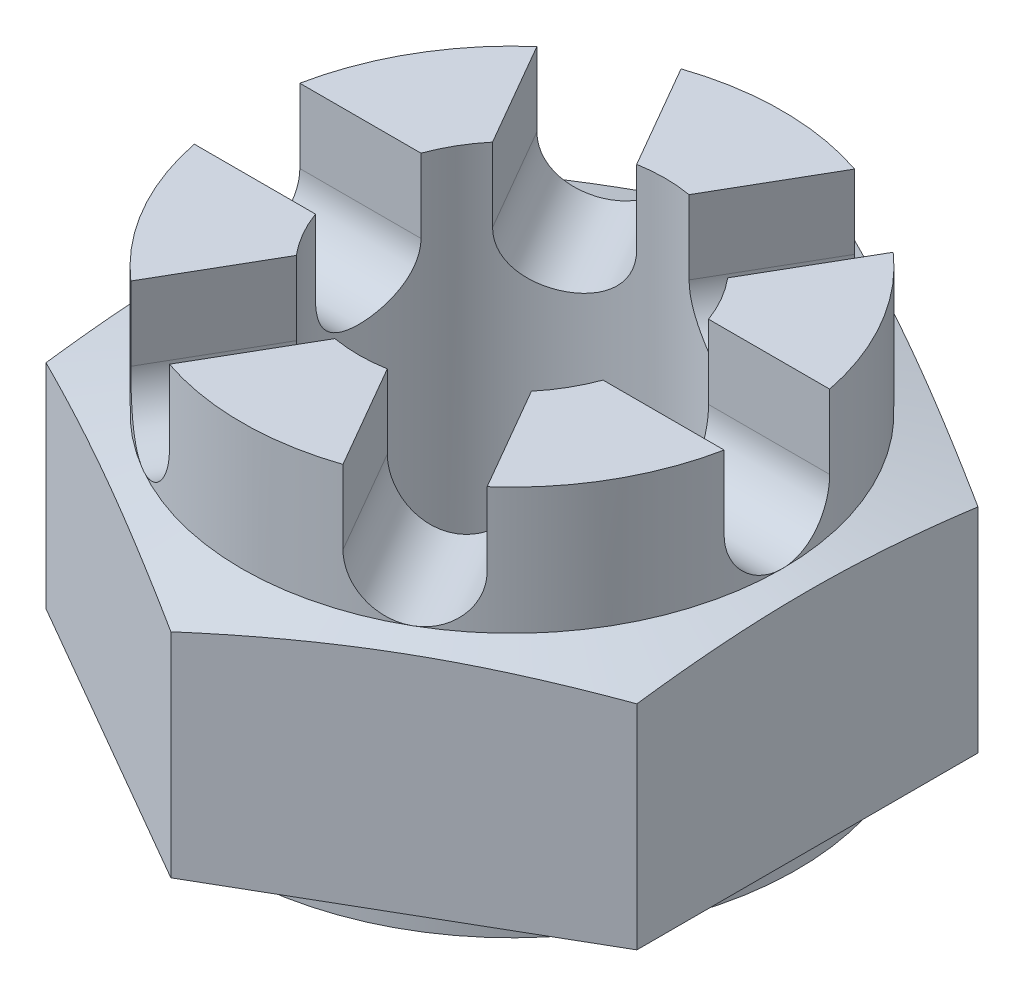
ISO-10303-21;
HEADER;
FILE_DESCRIPTION(('STEP AP214'),'2;1');
FILE_NAME('part.step','',(''),(''),'','','');
FILE_SCHEMA(('AUTOMOTIVE_DESIGN { 1 0 10303 214 1 1 1 1 }'));
ENDSEC;
DATA;
#1=APPLICATION_CONTEXT('core data for automotive mechanical design processes');
#2=APPLICATION_PROTOCOL_DEFINITION('international standard','automotive_design',2000,#1);
#3=PRODUCT_CONTEXT('',#1,'mechanical');
#4=PRODUCT('Part','Part','',(#3));
#5=PRODUCT_RELATED_PRODUCT_CATEGORY('part','',(#4));
#6=PRODUCT_DEFINITION_FORMATION('','',#4);
#7=PRODUCT_DEFINITION_CONTEXT('part definition',#1,'design');
#8=PRODUCT_DEFINITION('design','',#6,#7);
#9=PRODUCT_DEFINITION_SHAPE('','',#8);
#10=(LENGTH_UNIT() NAMED_UNIT(*) SI_UNIT(.MILLI.,.METRE.));
#11=(NAMED_UNIT(*) PLANE_ANGLE_UNIT() SI_UNIT($,.RADIAN.));
#12=(NAMED_UNIT(*) SI_UNIT($,.STERADIAN.) SOLID_ANGLE_UNIT());
#13=UNCERTAINTY_MEASURE_WITH_UNIT(LENGTH_MEASURE(1.E-05),#10,'distance_accuracy_value','');
#14=(GEOMETRIC_REPRESENTATION_CONTEXT(3) GLOBAL_UNCERTAINTY_ASSIGNED_CONTEXT((#13)) GLOBAL_UNIT_ASSIGNED_CONTEXT((#10,
#11,#12)) REPRESENTATION_CONTEXT('',''));
#15=CARTESIAN_POINT('',(0.,0.,0.));
#16=DIRECTION('',(0.,0.,1.));
#17=DIRECTION('',(1.,0.,0.));
#18=AXIS2_PLACEMENT_3D('',#15,#16,#17);
#19=CARTESIAN_POINT('',(0.,7.14375,0.));
#20=DIRECTION('',(0.,1.,0.));
#21=DIRECTION('',(0.,0.,1.));
#22=AXIS2_PLACEMENT_3D('',#19,#20,#21);
#23=PLANE('',#22);
#24=DIRECTION('',(0.499999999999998,0.,0.86602540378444));
#25=VECTOR('',#24,1.);
#26=CARTESIAN_POINT('',(-3.30792791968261,7.14375,-7.71387422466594));
#27=LINE('',#26,#25);
#28=CARTESIAN_POINT('',(-1.63182271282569,7.14375,-4.81077484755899));
#29=VERTEX_POINT('',#28);
#30=CARTESIAN_POINT('',(-0.49277940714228,7.14375,-2.83789397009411));
#31=VERTEX_POINT('',#30);
#32=EDGE_CURVE('E446',#29,#31,#27,.T.);
#33=ORIENTED_EDGE('',*,*,#32,.T.);
#34=CARTESIAN_POINT('',(0.,7.14375,0.));
#35=DIRECTION('',(0.,1.,0.));
#36=DIRECTION('',(0.,0.,1.));
#37=AXIS2_PLACEMENT_3D('',#34,#35,#36);
#38=CIRCLE('',#37,2.88036);
#39=CARTESIAN_POINT('',(0.492779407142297,7.14375,-2.8378939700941));
#40=VERTEX_POINT('',#39);
#41=EDGE_CURVE('E468',#40,#31,#38,.T.);
#42=ORIENTED_EDGE('',*,*,#41,.F.);
#43=DIRECTION('',(-0.500000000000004,0.,0.866025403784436));
#44=VECTOR('',#43,1.);
#45=CARTESIAN_POINT('',(3.30792791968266,7.14375,-7.71387422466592));
#46=LINE('',#45,#44);
#47=CARTESIAN_POINT('',(1.63182271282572,7.14375,-4.81077484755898));
#48=VERTEX_POINT('',#47);
#49=EDGE_CURVE('E451',#48,#40,#46,.T.);
#50=ORIENTED_EDGE('',*,*,#49,.F.);
#51=CARTESIAN_POINT('',(0.,7.14375,0.));
#52=DIRECTION('',(0.,-1.,0.));
#53=DIRECTION('',(0.,0.,-1.));
#54=AXIS2_PLACEMENT_3D('',#51,#52,#53);
#55=CIRCLE('',#54,5.08);
#56=EDGE_CURVE('E470',#29,#48,#55,.T.);
#57=ORIENTED_EDGE('',*,*,#56,.F.);
#58=EDGE_LOOP('',(#33,#42,#50,#57));
#59=FACE_BOUND('',#58,.T.);
#60=ADVANCED_FACE('F35',(#59),#23,.T.);
#61=DIRECTION('',(0.499999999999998,0.,0.86602540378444));
#62=VECTOR('',#61,1.);
#63=CARTESIAN_POINT('',(-5.02644708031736,7.14375,-6.72168672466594));
#64=LINE('',#63,#62);
#65=CARTESIAN_POINT('',(-3.35034187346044,7.14375,-3.81858734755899));
#66=VERTEX_POINT('',#65);
#67=CARTESIAN_POINT('',(-2.21129856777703,7.14375,-1.84570647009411));
#68=VERTEX_POINT('',#67);
#69=EDGE_CURVE('E460',#66,#68,#64,.T.);
#70=ORIENTED_EDGE('',*,*,#69,.F.);
#71=CARTESIAN_POINT('',(-4.98216458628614,7.14375,-0.992187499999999));
#72=VERTEX_POINT('',#71);
#73=EDGE_CURVE('E655',#72,#66,#55,.T.);
#74=ORIENTED_EDGE('',*,*,#73,.F.);
#75=DIRECTION('',(1.,0.,0.));
#76=VECTOR('',#75,1.);
#77=CARTESIAN_POINT('',(-5.55625,7.14375,-0.992187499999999));
#78=LINE('',#77,#76);
#79=CARTESIAN_POINT('',(-2.70407797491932,7.14375,-0.992187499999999));
#80=VERTEX_POINT('',#79);
#81=EDGE_CURVE('E614',#72,#80,#78,.T.);
#82=ORIENTED_EDGE('',*,*,#81,.T.);
#83=EDGE_CURVE('E477',#68,#80,#38,.T.);
#84=ORIENTED_EDGE('',*,*,#83,.F.);
#85=EDGE_LOOP('',(#70,#74,#82,#84));
#86=FACE_BOUND('',#85,.T.);
#87=ADVANCED_FACE('F566',(#86),#23,.T.);
#88=DIRECTION('',(-1.,0.,0.));
#89=VECTOR('',#88,1.);
#90=CARTESIAN_POINT('',(5.55625,7.14375,0.992187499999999));
#91=LINE('',#90,#89);
#92=CARTESIAN_POINT('',(4.98216458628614,7.14375,0.992187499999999));
#93=VERTEX_POINT('',#92);
#94=CARTESIAN_POINT('',(2.70407797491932,7.14375,0.992187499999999));
#95=VERTEX_POINT('',#94);
#96=EDGE_CURVE('E431',#93,#95,#91,.T.);
#97=ORIENTED_EDGE('',*,*,#96,.T.);
#98=CARTESIAN_POINT('',(2.21129856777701,7.14375,1.84570647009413));
#99=VERTEX_POINT('',#98);
#100=EDGE_CURVE('E428',#99,#95,#38,.T.);
#101=ORIENTED_EDGE('',*,*,#100,.F.);
#102=DIRECTION('',(-0.499999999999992,0.,-0.866025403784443));
#103=VECTOR('',#102,1.);
#104=CARTESIAN_POINT('',(5.0264470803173,7.14375,6.72168672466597));
#105=LINE('',#104,#103);
#106=CARTESIAN_POINT('',(3.35034187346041,7.14375,3.81858734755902));
#107=VERTEX_POINT('',#106);
#108=EDGE_CURVE('E702',#107,#99,#105,.T.);
#109=ORIENTED_EDGE('',*,*,#108,.F.);
#110=EDGE_CURVE('E438',#93,#107,#55,.T.);
#111=ORIENTED_EDGE('',*,*,#110,.F.);
#112=EDGE_LOOP('',(#97,#101,#109,#111));
#113=FACE_BOUND('',#112,.T.);
#114=ADVANCED_FACE('F435',(#113),#23,.T.);
#115=DIRECTION('',(-0.499999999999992,0.,-0.866025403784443));
#116=VECTOR('',#115,1.);
#117=CARTESIAN_POINT('',(3.30792791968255,7.14375,7.71387422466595));
#118=LINE('',#117,#116);
#119=CARTESIAN_POINT('',(1.63182271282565,7.14375,4.810774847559));
#120=VERTEX_POINT('',#119);
#121=CARTESIAN_POINT('',(0.49277940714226,7.14375,2.83789397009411));
#122=VERTEX_POINT('',#121);
#123=EDGE_CURVE('E272',#120,#122,#118,.T.);
#124=ORIENTED_EDGE('',*,*,#123,.T.);
#125=CARTESIAN_POINT('',(-0.492779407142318,7.14375,2.8378939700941));
#126=VERTEX_POINT('',#125);
#127=EDGE_CURVE('E484',#126,#122,#38,.T.);
#128=ORIENTED_EDGE('',*,*,#127,.F.);
#129=DIRECTION('',(0.50000000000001,0.,-0.866025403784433));
#130=VECTOR('',#129,1.);
#131=CARTESIAN_POINT('',(-3.30792791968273,7.14375,7.71387422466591));
#132=LINE('',#131,#130);
#133=CARTESIAN_POINT('',(-1.63182271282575,7.14375,4.81077484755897));
#134=VERTEX_POINT('',#133);
#135=EDGE_CURVE('E256',#134,#126,#132,.T.);
#136=ORIENTED_EDGE('',*,*,#135,.F.);
#137=EDGE_CURVE('E656',#120,#134,#55,.T.);
#138=ORIENTED_EDGE('',*,*,#137,.F.);
#139=EDGE_LOOP('',(#124,#128,#136,#138));
#140=FACE_BOUND('',#139,.T.);
#141=ADVANCED_FACE('F583',(#140),#23,.T.);
#142=CARTESIAN_POINT('',(-2.21129856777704,7.14375,1.8457064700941));
#143=VERTEX_POINT('',#142);
#144=CARTESIAN_POINT('',(-3.35034187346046,7.14375,3.81858734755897));
#145=VERTEX_POINT('',#144);
#146=EDGE_CURVE('E453',#143,#145,#46,.T.);
#147=ORIENTED_EDGE('',*,*,#146,.F.);
#148=CARTESIAN_POINT('',(-2.70407797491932,7.14375,0.9921875));
#149=VERTEX_POINT('',#148);
#150=EDGE_CURVE('E480',#149,#143,#38,.T.);
#151=ORIENTED_EDGE('',*,*,#150,.F.);
#152=DIRECTION('',(1.,0.,0.));
#153=VECTOR('',#152,1.);
#154=CARTESIAN_POINT('',(-5.55625,7.14375,0.992187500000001));
#155=LINE('',#154,#153);
#156=CARTESIAN_POINT('',(-4.98216458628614,7.14375,0.9921875));
#157=VERTEX_POINT('',#156);
#158=EDGE_CURVE('E673',#157,#149,#155,.T.);
#159=ORIENTED_EDGE('',*,*,#158,.F.);
#160=EDGE_CURVE('E596',#145,#157,#55,.T.);
#161=ORIENTED_EDGE('',*,*,#160,.F.);
#162=EDGE_LOOP('',(#147,#151,#159,#161));
#163=FACE_BOUND('',#162,.T.);
#164=ADVANCED_FACE('F574',(#163),#23,.T.);
#165=CARTESIAN_POINT('',(0.,0.,0.));
#166=DIRECTION('',(0.,-1.,0.));
#167=DIRECTION('',(0.,0.,-1.));
#168=AXIS2_PLACEMENT_3D('',#165,#166,#167);
#169=CYLINDRICAL_SURFACE('',#168,5.08);
#170=CARTESIAN_POINT('',(-3.35034187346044,5.7546875,-3.81858734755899));
#171=CARTESIAN_POINT('',(-3.350341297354,5.72705749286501,-3.8185860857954));
#172=CARTESIAN_POINT('',(-3.3494567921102,5.69944099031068,-3.81936408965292));
#173=CARTESIAN_POINT('',(-3.34592534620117,5.64441092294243,-3.82245886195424));
#174=CARTESIAN_POINT('',(-3.34327861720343,5.61699733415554,-3.8247754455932));
#175=CARTESIAN_POINT('',(-3.33271961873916,5.53544386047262,-3.83398912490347));
#176=CARTESIAN_POINT('',(-3.32218846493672,5.48185867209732,-3.84315034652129));
#177=CARTESIAN_POINT('',(-3.2943523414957,5.37780586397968,-3.86703692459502));
#178=CARTESIAN_POINT('',(-3.2770465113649,5.327338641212,-3.88176298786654));
#179=CARTESIAN_POINT('',(-3.23599354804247,5.23085582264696,-3.91605139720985));
#180=CARTESIAN_POINT('',(-3.21224583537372,5.18484062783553,-3.93561417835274));
#181=CARTESIAN_POINT('',(-3.15843488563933,5.09796980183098,-3.9789311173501));
#182=CARTESIAN_POINT('',(-3.12829941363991,5.0571825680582,-4.00273266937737));
#183=CARTESIAN_POINT('',(-3.0624709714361,4.98251497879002,-4.05331859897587));
#184=CARTESIAN_POINT('',(-3.02677714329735,4.94863569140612,-4.08010343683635));
#185=CARTESIAN_POINT('',(-2.95025430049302,4.88848479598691,-4.13577723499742));
#186=CARTESIAN_POINT('',(-2.9093852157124,4.86227849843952,-4.16468178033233));
#187=CARTESIAN_POINT('',(-2.82369858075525,4.81863974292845,-4.22324705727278));
#188=CARTESIAN_POINT('',(-2.77888160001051,4.80120602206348,-4.2529076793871));
#189=CARTESIAN_POINT('',(-2.6870332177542,4.77581938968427,-4.31151732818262));
#190=CARTESIAN_POINT('',(-2.64003672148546,4.76775008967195,-4.34047061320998));
#191=CARTESIAN_POINT('',(-2.54461620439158,4.76095835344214,-4.39709049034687));
#192=CARTESIAN_POINT('',(-2.49619228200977,4.76223527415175,-4.42475717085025));
#193=CARTESIAN_POINT('',(-2.40000479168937,4.77401143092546,-4.47765007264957));
#194=CARTESIAN_POINT('',(-2.35224119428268,4.78438507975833,-4.50290435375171));
#195=CARTESIAN_POINT('',(-2.25813354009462,4.81386116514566,-4.55082663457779));
#196=CARTESIAN_POINT('',(-2.21178952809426,4.83296387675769,-4.5734945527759));
#197=CARTESIAN_POINT('',(-2.12165180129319,4.87947376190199,-4.6160041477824));
#198=CARTESIAN_POINT('',(-2.07787528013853,4.906930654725,-4.6358278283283));
#199=CARTESIAN_POINT('',(-1.99453557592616,4.96933194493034,-4.67229066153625));
#200=CARTESIAN_POINT('',(-1.95497271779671,5.00427691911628,-4.68892956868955));
#201=CARTESIAN_POINT('',(-1.88070938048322,5.08134734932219,-4.71921282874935));
#202=CARTESIAN_POINT('',(-1.84609998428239,5.12358185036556,-4.73280319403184));
#203=CARTESIAN_POINT('',(-1.78371645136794,5.21368661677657,-4.75666637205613));
#204=CARTESIAN_POINT('',(-1.7559442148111,5.26155844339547,-4.76693826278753));
#205=CARTESIAN_POINT('',(-1.70820333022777,5.3617335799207,-4.78425442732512));
#206=CARTESIAN_POINT('',(-1.68825453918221,5.41404776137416,-4.79129049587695));
#207=CARTESIAN_POINT('',(-1.6570698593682,5.52148630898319,-4.80216584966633));
#208=CARTESIAN_POINT('',(-1.64582098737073,5.57660635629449,-4.80600989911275));
#209=CARTESIAN_POINT('',(-1.63670163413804,5.6525845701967,-4.80911753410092));
#210=CARTESIAN_POINT('',(-1.63487165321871,5.67297513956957,-4.80973971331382));
#211=CARTESIAN_POINT('',(-1.63243368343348,5.7138032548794,-4.81056775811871));
#212=CARTESIAN_POINT('',(-1.63182364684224,5.73424066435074,-4.81077432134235));
#213=CARTESIAN_POINT('',(-1.63182271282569,5.7546875,-4.81077484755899));
#214=B_SPLINE_CURVE_WITH_KNOTS('',3,(#170,#171,#172,#173,#174,#175,#176,#177,#178,#179,#180,
#181,#182,#183,#184,#185,#186,#187,#188,#189,#190,#191,#192,#193,#194,#195,#196,#197,#198,#199,
#200,#201,#202,#203,#204,#205,#206,#207,#208,#209,#210,#211,#212,#213),.UNSPECIFIED.,.F.,.F.,(4,
2,2,2,2,2,2,2,2,2,2,2,2,2,2,2,2,2,2,2,2,4),(0.,0.0828382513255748,0.165666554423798,
0.330930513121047,0.496215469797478,0.661515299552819,0.828794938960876,0.996100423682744,
1.16479111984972,1.33345752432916,1.50000436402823,1.66653974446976,1.8308115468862,
1.99508852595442,2.1603629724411,2.3256501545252,2.49366679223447,2.66173007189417,
2.83021720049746,2.9984524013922,3.05986714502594,3.12117871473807),.UNSPECIFIED.);
#215=CARTESIAN_POINT('',(-2.53999999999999,4.7624999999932,-4.39940905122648));
#216=VERTEX_POINT('',#215);
#217=CARTESIAN_POINT('',(-1.63182271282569,5.7546875,-4.81077484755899));
#218=VERTEX_POINT('',#217);
#219=EDGE_CURVE('E44',#216,#218,#214,.T.);
#220=ORIENTED_EDGE('',*,*,#219,.T.);
#221=DIRECTION('',(0.,-1.,0.));
#222=VECTOR('',#221,1.);
#223=CARTESIAN_POINT('',(-1.63182271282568,0.,-4.81077484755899));
#224=LINE('',#223,#222);
#225=EDGE_CURVE('E11',#218,#29,#224,.F.);
#226=ORIENTED_EDGE('',*,*,#225,.T.);
#227=ORIENTED_EDGE('',*,*,#56,.T.);
#228=DIRECTION('',(0.,-1.,0.));
#229=VECTOR('',#228,1.);
#230=CARTESIAN_POINT('',(1.63182271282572,0.,-4.81077484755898));
#231=LINE('',#230,#229);
#232=CARTESIAN_POINT('',(1.63182271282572,5.7546875,-4.81077484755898));
#233=VERTEX_POINT('',#232);
#234=EDGE_CURVE('E731',#48,#233,#231,.T.);
#235=ORIENTED_EDGE('',*,*,#234,.T.);
#236=CARTESIAN_POINT('',(1.63182271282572,5.7546875,-4.81077484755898));
#237=CARTESIAN_POINT('',(1.63182190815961,5.72705749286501,-4.81077371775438));
#238=CARTESIAN_POINT('',(1.63293793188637,5.69944099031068,-4.81039671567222));
#239=CARTESIAN_POINT('',(1.63738380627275,5.64441092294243,-4.80888577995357));
#240=CARTESIAN_POINT('',(1.64071339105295,5.61699733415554,-4.80775193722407));
#241=CARTESIAN_POINT('',(1.65397217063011,5.53544386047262,-4.80321441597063));
#242=CARTESIAN_POINT('',(1.66717159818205,5.48185867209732,-4.79867478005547));
#243=CARTESIAN_POINT('',(1.7017760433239,5.37780586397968,-4.78651127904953));
#244=CARTESIAN_POINT('',(1.72318210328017,5.327338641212,-4.77888702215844));
#245=CARTESIAN_POINT('',(1.77340321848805,5.23085582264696,-4.76047831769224));
#246=CARTESIAN_POINT('',(1.80221894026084,5.18484062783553,-4.74969358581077));
#247=CARTESIAN_POINT('',(1.86663798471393,5.09796980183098,-4.7247504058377));
#248=CARTESIAN_POINT('',(1.90231846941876,5.0571825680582,-4.71055309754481));
#249=CARTESIAN_POINT('',(1.97904139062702,4.98251497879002,-4.678836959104));
#250=CARTESIAN_POINT('',(2.02008465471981,4.94863569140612,-4.66131761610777));
#251=CARTESIAN_POINT('',(2.10656099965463,4.88848479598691,-4.62288378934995));
#252=CARTESIAN_POINT('',(2.15202761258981,4.86227849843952,-4.60194239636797));
#253=CARTESIAN_POINT('',(2.24558994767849,4.81863974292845,-4.55701823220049));
#254=CARTESIAN_POINT('',(2.29368529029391,4.80120602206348,-4.5330358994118));
#255=CARTESIAN_POINT('',(2.39036692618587,4.77581938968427,-4.48279769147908));
#256=CARTESIAN_POINT('',(2.43893945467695,4.76775008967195,-4.45657417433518));
#257=CARTESIAN_POINT('',(2.53568396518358,4.76095835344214,-4.40224752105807));
#258=CARTESIAN_POINT('',(2.5838559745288,4.76223527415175,-4.37414451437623));
#259=CARTESIAN_POINT('',(2.6777563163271,4.77401143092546,-4.31729015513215));
#260=CARTESIAN_POINT('',(2.7235089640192,4.78438507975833,-4.2885528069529));
#261=CARTESIAN_POINT('',(2.81206470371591,4.81386116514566,-4.23101432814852));
#262=CARTESIAN_POINT('',(2.85486770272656,4.83296387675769,-4.20221319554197));
#263=CARTESIAN_POINT('',(2.93675095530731,4.87947376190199,-4.14540643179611));
#264=CARTESIAN_POINT('',(2.9758070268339,4.906930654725,-4.11740669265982));
#265=CARTESIAN_POINT('',(3.04905461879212,4.96933194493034,-4.063463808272));
#266=CARTESIAN_POINT('',(3.08324576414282,5.00427691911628,-4.03752082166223));
#267=CARTESIAN_POINT('',(3.14660350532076,5.08134734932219,-3.98834851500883));
#268=CARTESIAN_POINT('',(3.17567780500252,5.12358185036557,-3.96517108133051));
#269=CARTESIAN_POINT('',(3.22753568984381,5.21368661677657,-3.92307694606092));
#270=CARTESIAN_POINT('',(3.25031752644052,5.26155844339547,-3.90416142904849));
#271=CARTESIAN_POINT('',(3.28918420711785,5.3617335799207,-3.87147469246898));
#272=CARTESIAN_POINT('',(3.30525201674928,5.41404776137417,-3.85771656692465));
#273=CARTESIAN_POINT('',(3.33026268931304,5.52148630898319,-3.83614751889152));
#274=CARTESIAN_POINT('',(3.33921616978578,5.57660635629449,-3.82832773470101));
#275=CARTESIAN_POINT('',(3.34646713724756,5.6525845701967,-3.8219839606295));
#276=CARTESIAN_POINT('',(3.3479209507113,5.67297513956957,-3.82071024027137));
#277=CARTESIAN_POINT('',(3.34985704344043,5.7138032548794,-3.81901291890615));
#278=CARTESIAN_POINT('',(3.3503409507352,5.73424066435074,-3.81858789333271));
#279=CARTESIAN_POINT('',(3.35034187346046,5.7546875,-3.81858734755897));
#280=B_SPLINE_CURVE_WITH_KNOTS('',3,(#236,#237,#238,#239,#240,#241,#242,#243,#244,#245,#246,
#247,#248,#249,#250,#251,#252,#253,#254,#255,#256,#257,#258,#259,#260,#261,#262,#263,#264,#265,
#266,#267,#268,#269,#270,#271,#272,#273,#274,#275,#276,#277,#278,#279),.UNSPECIFIED.,.F.,.F.,(4,
2,2,2,2,2,2,2,2,2,2,2,2,2,2,2,2,2,2,2,2,4),(0.,0.0828382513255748,0.165666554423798,
0.330930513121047,0.496215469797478,0.661515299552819,0.828794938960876,0.996100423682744,
1.16479111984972,1.33345752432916,1.50000436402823,1.66653974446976,1.8308115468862,
1.99508852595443,2.16036297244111,2.3256501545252,2.49366679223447,2.66173007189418,
2.83021720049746,2.9984524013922,3.05986714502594,3.12117871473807),.UNSPECIFIED.);
#281=CARTESIAN_POINT('',(2.54000000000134,4.7624999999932,-4.3994090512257));
#282=VERTEX_POINT('',#281);
#283=EDGE_CURVE('E649',#233,#282,#280,.T.);
#284=ORIENTED_EDGE('',*,*,#283,.T.);
#285=CARTESIAN_POINT('',(0.,4.7625,0.));
#286=DIRECTION('',(0.,-1.,0.));
#287=DIRECTION('',(0.,0.,-1.));
#288=AXIS2_PLACEMENT_3D('',#285,#286,#287);
#289=CIRCLE('',#288,5.08);
#290=EDGE_CURVE('E724',#216,#282,#289,.T.);
#291=ORIENTED_EDGE('',*,*,#290,.F.);
#292=EDGE_LOOP('',(#220,#226,#227,#235,#284,#291));
#293=FACE_BOUND('',#292,.T.);
#294=ADVANCED_FACE('F364',(#293),#169,.T.);
#295=DIRECTION('',(0.,-1.,0.));
#296=VECTOR('',#295,1.);
#297=CARTESIAN_POINT('',(-3.35034187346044,0.,-3.81858734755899));
#298=LINE('',#297,#296);
#299=CARTESIAN_POINT('',(-3.35034187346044,5.7546875,-3.81858734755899));
#300=VERTEX_POINT('',#299);
#301=EDGE_CURVE('E728',#66,#300,#298,.T.);
#302=ORIENTED_EDGE('',*,*,#301,.T.);
#303=EDGE_CURVE('E727',#300,#216,#214,.T.);
#304=ORIENTED_EDGE('',*,*,#303,.T.);
#305=CARTESIAN_POINT('',(-5.08000000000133,4.7624999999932,-7.61098255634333E-13));
#306=VERTEX_POINT('',#305);
#307=EDGE_CURVE('E534',#306,#216,#289,.T.);
#308=ORIENTED_EDGE('',*,*,#307,.F.);
#309=CARTESIAN_POINT('',(-4.98216458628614,5.7546875,0.9921875));
#310=CARTESIAN_POINT('',(-4.9821632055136,5.72705749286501,0.992187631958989));
#311=CARTESIAN_POINT('',(-4.98239472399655,5.69944099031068,0.991032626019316));
#312=CARTESIAN_POINT('',(-4.98330915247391,5.64441092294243,0.986426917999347));
#313=CARTESIAN_POINT('',(-4.98399200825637,5.61699733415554,0.982976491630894));
#314=CARTESIAN_POINT('',(-4.98669178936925,5.53544386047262,0.969225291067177));
#315=CARTESIAN_POINT('',(-4.98936006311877,5.48185867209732,0.955524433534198));
#316=CARTESIAN_POINT('',(-4.99612838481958,5.37780586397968,0.919474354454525));
#317=CARTESIAN_POINT('',(-5.00022861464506,5.327338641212,0.89712403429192));
#318=CARTESIAN_POINT('',(-5.00939676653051,5.23085582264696,0.844426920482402));
#319=CARTESIAN_POINT('',(-5.01446477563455,5.18484062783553,0.814079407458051));
#320=CARTESIAN_POINT('',(-5.02507287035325,5.09796980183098,0.74581928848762));
#321=CARTESIAN_POINT('',(-5.03061788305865,5.0571825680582,0.707820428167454));
#322=CARTESIAN_POINT('',(-5.0415123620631,4.98251497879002,0.625518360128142));
#323=CARTESIAN_POINT('',(-5.04686179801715,4.94863569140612,0.581214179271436));
#324=CARTESIAN_POINT('',(-5.05681530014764,4.8884847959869,0.487106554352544));
#325=CARTESIAN_POINT('',(-5.0614128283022,4.86227849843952,0.437260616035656));
#326=CARTESIAN_POINT('',(-5.06928852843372,4.81863974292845,0.333771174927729));
#327=CARTESIAN_POINT('',(-5.07256689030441,4.80120602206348,0.280128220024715));
#328=CARTESIAN_POINT('',(-5.07740014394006,4.77581938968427,0.171280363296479));
#329=CARTESIAN_POINT('',(-5.0789761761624,4.76775008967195,0.116103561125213));
#330=CARTESIAN_POINT('',(-5.08030016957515,4.76095835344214,0.00515703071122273));
#331=CARTESIAN_POINT('',(-5.08004825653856,4.76223527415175,-0.0506126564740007));
#332=CARTESIAN_POINT('',(-5.07776110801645,4.77401143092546,-0.160359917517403));
#333=CARTESIAN_POINT('',(-5.07575015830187,4.78438507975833,-0.214351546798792));
#334=CARTESIAN_POINT('',(-5.07019824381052,4.81386116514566,-0.319812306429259));
#335=CARTESIAN_POINT('',(-5.06665723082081,4.83296387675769,-0.371281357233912));
#336=CARTESIAN_POINT('',(-5.05840275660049,4.87947376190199,-0.470597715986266));
#337=CARTESIAN_POINT('',(-5.05368230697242,4.906930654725,-0.518421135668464));
#338=CARTESIAN_POINT('',(-5.04359019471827,4.96933194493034,-0.608826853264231));
#339=CARTESIAN_POINT('',(-5.03821848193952,5.00427691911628,-0.651408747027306));
#340=CARTESIAN_POINT('',(-5.02731288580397,5.08134734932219,-0.730864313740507));
#341=CARTESIAN_POINT('',(-5.0217777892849,5.12358185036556,-0.767632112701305));
#342=CARTESIAN_POINT('',(-5.01125214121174,5.21368661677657,-0.833589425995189));
#343=CARTESIAN_POINT('',(-5.00626174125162,5.26155844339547,-0.86277683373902));
#344=CARTESIAN_POINT('',(-4.99738753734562,5.3617335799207,-0.91277973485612));
#345=CARTESIAN_POINT('',(-4.99350655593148,5.41404776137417,-0.93357392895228));
#346=CARTESIAN_POINT('',(-4.98733254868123,5.52148630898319,-0.96601833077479));
#347=CARTESIAN_POINT('',(-4.9850371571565,5.57660635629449,-0.977682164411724));
#348=CARTESIAN_POINT('',(-4.9831687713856,5.6525845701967,-0.9871335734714));
#349=CARTESIAN_POINT('',(-4.98279260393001,5.67297513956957,-0.98902947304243));
#350=CARTESIAN_POINT('',(-4.9822907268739,5.7138032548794,-0.991554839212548));
#351=CARTESIAN_POINT('',(-4.98216459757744,5.73424066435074,-0.992186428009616));
#352=CARTESIAN_POINT('',(-4.98216458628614,5.7546875,-0.9921875));
#353=B_SPLINE_CURVE_WITH_KNOTS('',3,(#309,#310,#311,#312,#313,#314,#315,#316,#317,#318,#319,
#320,#321,#322,#323,#324,#325,#326,#327,#328,#329,#330,#331,#332,#333,#334,#335,#336,#337,#338,
#339,#340,#341,#342,#343,#344,#345,#346,#347,#348,#349,#350,#351,#352),.UNSPECIFIED.,.F.,.F.,(4,
2,2,2,2,2,2,2,2,2,2,2,2,2,2,2,2,2,2,2,2,4),(0.,0.0828382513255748,0.165666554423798,
0.330930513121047,0.496215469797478,0.661515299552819,0.828794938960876,0.996100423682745,
1.16479111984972,1.33345752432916,1.50000436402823,1.66653974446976,1.8308115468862,
1.99508852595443,2.16036297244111,2.3256501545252,2.49366679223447,2.66173007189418,
2.83021720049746,2.9984524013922,3.05986714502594,3.12117871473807),.UNSPECIFIED.);
#354=CARTESIAN_POINT('',(-4.98216458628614,5.7546875,-0.9921875));
#355=VERTEX_POINT('',#354);
#356=EDGE_CURVE('E684',#306,#355,#353,.T.);
#357=ORIENTED_EDGE('',*,*,#356,.T.);
#358=DIRECTION('',(0.,-1.,0.));
#359=VECTOR('',#358,1.);
#360=CARTESIAN_POINT('',(-4.98216458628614,0.,-0.992187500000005));
#361=LINE('',#360,#359);
#362=EDGE_CURVE('E688',#355,#72,#361,.F.);
#363=ORIENTED_EDGE('',*,*,#362,.T.);
#364=ORIENTED_EDGE('',*,*,#73,.T.);
#365=EDGE_LOOP('',(#302,#304,#308,#357,#363,#364));
#366=FACE_BOUND('',#365,.T.);
#367=ADVANCED_FACE('F589',(#366),#169,.T.);
#368=CARTESIAN_POINT('',(4.98216458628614,5.7546875,-0.9921875));
#369=CARTESIAN_POINT('',(4.9821632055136,5.72705749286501,-0.992187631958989));
#370=CARTESIAN_POINT('',(4.98239472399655,5.69944099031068,-0.991032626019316));
#371=CARTESIAN_POINT('',(4.98330915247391,5.64441092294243,-0.986426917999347));
#372=CARTESIAN_POINT('',(4.98399200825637,5.61699733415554,-0.982976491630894));
#373=CARTESIAN_POINT('',(4.98669178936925,5.53544386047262,-0.969225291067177));
#374=CARTESIAN_POINT('',(4.98936006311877,5.48185867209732,-0.955524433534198));
#375=CARTESIAN_POINT('',(4.99612838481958,5.37780586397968,-0.919474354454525));
#376=CARTESIAN_POINT('',(5.00022861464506,5.327338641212,-0.897124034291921));
#377=CARTESIAN_POINT('',(5.00939676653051,5.23085582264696,-0.844426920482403));
#378=CARTESIAN_POINT('',(5.01446477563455,5.18484062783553,-0.814079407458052));
#379=CARTESIAN_POINT('',(5.02507287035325,5.09796980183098,-0.74581928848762));
#380=CARTESIAN_POINT('',(5.03061788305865,5.0571825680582,-0.707820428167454));
#381=CARTESIAN_POINT('',(5.0415123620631,4.98251497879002,-0.625518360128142));
#382=CARTESIAN_POINT('',(5.04686179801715,4.94863569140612,-0.581214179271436));
#383=CARTESIAN_POINT('',(5.05681530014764,4.8884847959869,-0.487106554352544));
#384=CARTESIAN_POINT('',(5.0614128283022,4.86227849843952,-0.437260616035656));
#385=CARTESIAN_POINT('',(5.06928852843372,4.81863974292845,-0.333771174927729));
#386=CARTESIAN_POINT('',(5.07256689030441,4.80120602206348,-0.280128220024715));
#387=CARTESIAN_POINT('',(5.07740014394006,4.77581938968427,-0.171280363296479));
#388=CARTESIAN_POINT('',(5.0789761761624,4.76775008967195,-0.116103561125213));
#389=CARTESIAN_POINT('',(5.08030016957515,4.76095835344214,-0.00515703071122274));
#390=CARTESIAN_POINT('',(5.08004825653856,4.76223527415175,0.0506126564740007));
#391=CARTESIAN_POINT('',(5.07776110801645,4.77401143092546,0.160359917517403));
#392=CARTESIAN_POINT('',(5.07575015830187,4.78438507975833,0.214351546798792));
#393=CARTESIAN_POINT('',(5.07019824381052,4.81386116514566,0.319812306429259));
#394=CARTESIAN_POINT('',(5.06665723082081,4.83296387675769,0.371281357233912));
#395=CARTESIAN_POINT('',(5.05840275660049,4.87947376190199,0.470597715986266));
#396=CARTESIAN_POINT('',(5.05368230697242,4.906930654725,0.518421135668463));
#397=CARTESIAN_POINT('',(5.04359019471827,4.96933194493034,0.608826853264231));
#398=CARTESIAN_POINT('',(5.03821848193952,5.00427691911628,0.651408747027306));
#399=CARTESIAN_POINT('',(5.02731288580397,5.08134734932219,0.730864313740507));
#400=CARTESIAN_POINT('',(5.0217777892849,5.12358185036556,0.767632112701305));
#401=CARTESIAN_POINT('',(5.01125214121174,5.21368661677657,0.833589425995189));
#402=CARTESIAN_POINT('',(5.00626174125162,5.26155844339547,0.862776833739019));
#403=CARTESIAN_POINT('',(4.99738753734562,5.3617335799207,0.912779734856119));
#404=CARTESIAN_POINT('',(4.99350655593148,5.41404776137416,0.93357392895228));
#405=CARTESIAN_POINT('',(4.98733254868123,5.52148630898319,0.966018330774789));
#406=CARTESIAN_POINT('',(4.9850371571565,5.57660635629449,0.977682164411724));
#407=CARTESIAN_POINT('',(4.9831687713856,5.6525845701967,0.9871335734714));
#408=CARTESIAN_POINT('',(4.98279260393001,5.67297513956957,0.98902947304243));
#409=CARTESIAN_POINT('',(4.9822907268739,5.7138032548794,0.991554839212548));
#410=CARTESIAN_POINT('',(4.98216459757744,5.73424066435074,0.992186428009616));
#411=CARTESIAN_POINT('',(4.98216458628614,5.7546875,0.9921875));
#412=B_SPLINE_CURVE_WITH_KNOTS('',3,(#368,#369,#370,#371,#372,#373,#374,#375,#376,#377,#378,
#379,#380,#381,#382,#383,#384,#385,#386,#387,#388,#389,#390,#391,#392,#393,#394,#395,#396,#397,
#398,#399,#400,#401,#402,#403,#404,#405,#406,#407,#408,#409,#410,#411),.UNSPECIFIED.,.F.,.F.,(4,
2,2,2,2,2,2,2,2,2,2,2,2,2,2,2,2,2,2,2,2,4),(0.,0.0828382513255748,0.165666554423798,
0.330930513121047,0.496215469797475,0.661515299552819,0.828794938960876,0.996100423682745,
1.16479111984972,1.33345752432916,1.50000436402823,1.66653974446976,1.8308115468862,
1.99508852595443,2.16036297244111,2.3256501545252,2.49366679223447,2.66173007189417,
2.83021720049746,2.9984524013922,3.05986714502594,3.12117871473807),.UNSPECIFIED.);
#413=CARTESIAN_POINT('',(5.08000000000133,4.7624999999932,7.61098255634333E-13));
#414=VERTEX_POINT('',#413);
#415=CARTESIAN_POINT('',(4.98216458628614,5.7546875,0.9921875));
#416=VERTEX_POINT('',#415);
#417=EDGE_CURVE('E352',#414,#416,#412,.T.);
#418=ORIENTED_EDGE('',*,*,#417,.T.);
#419=DIRECTION('',(0.,-1.,0.));
#420=VECTOR('',#419,1.);
#421=CARTESIAN_POINT('',(4.98216458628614,0.,0.992187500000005));
#422=LINE('',#421,#420);
#423=EDGE_CURVE('E355',#416,#93,#422,.F.);
#424=ORIENTED_EDGE('',*,*,#423,.T.);
#425=ORIENTED_EDGE('',*,*,#110,.T.);
#426=DIRECTION('',(0.,-1.,0.));
#427=VECTOR('',#426,1.);
#428=CARTESIAN_POINT('',(3.35034187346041,0.,3.81858734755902));
#429=LINE('',#428,#427);
#430=CARTESIAN_POINT('',(3.35034187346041,5.7546875,3.81858734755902));
#431=VERTEX_POINT('',#430);
#432=EDGE_CURVE('E391',#107,#431,#429,.T.);
#433=ORIENTED_EDGE('',*,*,#432,.T.);
#434=CARTESIAN_POINT('',(3.35034187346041,5.7546875,3.81858734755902));
#435=CARTESIAN_POINT('',(3.35034129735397,5.72705749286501,3.81858608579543));
#436=CARTESIAN_POINT('',(3.34945679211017,5.69944099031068,3.81936408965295));
#437=CARTESIAN_POINT('',(3.34592534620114,5.64441092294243,3.82245886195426));
#438=CARTESIAN_POINT('',(3.3432786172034,5.61699733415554,3.82477544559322));
#439=CARTESIAN_POINT('',(3.33271961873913,5.53544386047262,3.83398912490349));
#440=CARTESIAN_POINT('',(3.3221884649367,5.48185867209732,3.84315034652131));
#441=CARTESIAN_POINT('',(3.29435234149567,5.37780586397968,3.86703692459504));
#442=CARTESIAN_POINT('',(3.27704651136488,5.327338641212,3.88176298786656));
#443=CARTESIAN_POINT('',(3.23599354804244,5.23085582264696,3.91605139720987));
#444=CARTESIAN_POINT('',(3.21224583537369,5.18484062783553,3.93561417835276));
#445=CARTESIAN_POINT('',(3.1584348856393,5.09796980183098,3.97893111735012));
#446=CARTESIAN_POINT('',(3.12829941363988,5.0571825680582,4.00273266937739));
#447=CARTESIAN_POINT('',(3.06247097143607,4.98251497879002,4.0533185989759));
#448=CARTESIAN_POINT('',(3.02677714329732,4.94863569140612,4.08010343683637));
#449=CARTESIAN_POINT('',(2.95025430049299,4.8884847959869,4.13577723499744));
#450=CARTESIAN_POINT('',(2.90938521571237,4.86227849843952,4.16468178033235));
#451=CARTESIAN_POINT('',(2.82369858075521,4.81863974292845,4.2232470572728));
#452=CARTESIAN_POINT('',(2.77888160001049,4.80120602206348,4.25290767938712));
#453=CARTESIAN_POINT('',(2.68703321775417,4.77581938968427,4.31151732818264));
#454=CARTESIAN_POINT('',(2.64003672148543,4.76775008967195,4.34047061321));
#455=CARTESIAN_POINT('',(2.54461620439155,4.76095835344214,4.39709049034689));
#456=CARTESIAN_POINT('',(2.49619228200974,4.76223527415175,4.42475717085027));
#457=CARTESIAN_POINT('',(2.40000479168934,4.77401143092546,4.47765007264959));
#458=CARTESIAN_POINT('',(2.35224119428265,4.78438507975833,4.50290435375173));
#459=CARTESIAN_POINT('',(2.25813354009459,4.81386116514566,4.55082663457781));
#460=CARTESIAN_POINT('',(2.21178952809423,4.83296387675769,4.57349455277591));
#461=CARTESIAN_POINT('',(2.12165180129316,4.87947376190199,4.61600414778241));
#462=CARTESIAN_POINT('',(2.0778752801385,4.906930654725,4.63582782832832));
#463=CARTESIAN_POINT('',(1.99453557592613,4.96933194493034,4.67229066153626));
#464=CARTESIAN_POINT('',(1.95497271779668,5.00427691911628,4.68892956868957));
#465=CARTESIAN_POINT('',(1.88070938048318,5.08134734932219,4.71921282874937));
#466=CARTESIAN_POINT('',(1.84609998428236,5.12358185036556,4.73280319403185));
#467=CARTESIAN_POINT('',(1.78371645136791,5.21368661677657,4.75666637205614));
#468=CARTESIAN_POINT('',(1.75594421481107,5.26155844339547,4.76693826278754));
#469=CARTESIAN_POINT('',(1.70820333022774,5.3617335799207,4.78425442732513));
#470=CARTESIAN_POINT('',(1.68825453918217,5.41404776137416,4.79129049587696));
#471=CARTESIAN_POINT('',(1.65706985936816,5.52148630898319,4.80216584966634));
#472=CARTESIAN_POINT('',(1.6458209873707,5.57660635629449,4.80600989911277));
#473=CARTESIAN_POINT('',(1.63670163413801,5.6525845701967,4.80911753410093));
#474=CARTESIAN_POINT('',(1.63487165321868,5.67297513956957,4.80973971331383));
#475=CARTESIAN_POINT('',(1.63243368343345,5.7138032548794,4.81056775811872));
#476=CARTESIAN_POINT('',(1.63182364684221,5.73424066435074,4.81077432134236));
#477=CARTESIAN_POINT('',(1.63182271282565,5.7546875,4.810774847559));
#478=B_SPLINE_CURVE_WITH_KNOTS('',3,(#434,#435,#436,#437,#438,#439,#440,#441,#442,#443,#444,
#445,#446,#447,#448,#449,#450,#451,#452,#453,#454,#455,#456,#457,#458,#459,#460,#461,#462,#463,
#464,#465,#466,#467,#468,#469,#470,#471,#472,#473,#474,#475,#476,#477),.UNSPECIFIED.,.F.,.F.,(4,
2,2,2,2,2,2,2,2,2,2,2,2,2,2,2,2,2,2,2,2,4),(0.,0.0828382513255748,0.165666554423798,
0.330930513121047,0.496215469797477,0.661515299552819,0.828794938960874,0.996100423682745,
1.16479111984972,1.33345752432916,1.50000436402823,1.66653974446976,1.8308115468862,
1.99508852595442,2.16036297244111,2.3256501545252,2.49366679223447,2.66173007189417,
2.83021720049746,2.9984524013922,3.05986714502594,3.12117871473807),.UNSPECIFIED.);
#479=CARTESIAN_POINT('',(2.53999999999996,4.7624999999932,4.3994090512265));
#480=VERTEX_POINT('',#479);
#481=EDGE_CURVE('E383',#431,#480,#478,.T.);
#482=ORIENTED_EDGE('',*,*,#481,.T.);
#483=EDGE_CURVE('E717',#414,#480,#289,.T.);
#484=ORIENTED_EDGE('',*,*,#483,.F.);
#485=EDGE_LOOP('',(#418,#424,#425,#433,#482,#484));
#486=FACE_BOUND('',#485,.T.);
#487=ADVANCED_FACE('F698',(#486),#169,.T.);
#488=CARTESIAN_POINT('',(1.63182271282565,5.7546875,4.810774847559));
#489=VERTEX_POINT('',#488);
#490=EDGE_CURVE('E390',#480,#489,#478,.T.);
#491=ORIENTED_EDGE('',*,*,#490,.T.);
#492=DIRECTION('',(0.,-1.,0.));
#493=VECTOR('',#492,1.);
#494=CARTESIAN_POINT('',(1.63182271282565,0.,4.810774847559));
#495=LINE('',#494,#493);
#496=EDGE_CURVE('E392',#489,#120,#495,.F.);
#497=ORIENTED_EDGE('',*,*,#496,.T.);
#498=ORIENTED_EDGE('',*,*,#137,.T.);
#499=DIRECTION('',(0.,-1.,0.));
#500=VECTOR('',#499,1.);
#501=CARTESIAN_POINT('',(-1.63182271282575,0.,4.81077484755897));
#502=LINE('',#501,#500);
#503=CARTESIAN_POINT('',(-1.63182271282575,5.7546875,4.81077484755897));
#504=VERTEX_POINT('',#503);
#505=EDGE_CURVE('E689',#134,#504,#502,.T.);
#506=ORIENTED_EDGE('',*,*,#505,.T.);
#507=CARTESIAN_POINT('',(-1.63182271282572,5.7546875,4.81077484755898));
#508=CARTESIAN_POINT('',(-1.63182190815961,5.72705749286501,4.81077371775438));
#509=CARTESIAN_POINT('',(-1.63293793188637,5.69944099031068,4.81039671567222));
#510=CARTESIAN_POINT('',(-1.63738380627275,5.64441092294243,4.80888577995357));
#511=CARTESIAN_POINT('',(-1.64071339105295,5.61699733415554,4.80775193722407));
#512=CARTESIAN_POINT('',(-1.65397217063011,5.53544386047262,4.80321441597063));
#513=CARTESIAN_POINT('',(-1.66717159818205,5.48185867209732,4.79867478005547));
#514=CARTESIAN_POINT('',(-1.7017760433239,5.37780586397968,4.78651127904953));
#515=CARTESIAN_POINT('',(-1.72318210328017,5.327338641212,4.77888702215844));
#516=CARTESIAN_POINT('',(-1.77340321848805,5.23085582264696,4.76047831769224));
#517=CARTESIAN_POINT('',(-1.80221894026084,5.18484062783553,4.74969358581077));
#518=CARTESIAN_POINT('',(-1.86663798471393,5.09796980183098,4.7247504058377));
#519=CARTESIAN_POINT('',(-1.90231846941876,5.0571825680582,4.71055309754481));
#520=CARTESIAN_POINT('',(-1.97904139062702,4.98251497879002,4.678836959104));
#521=CARTESIAN_POINT('',(-2.02008465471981,4.94863569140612,4.66131761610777));
#522=CARTESIAN_POINT('',(-2.10656099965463,4.8884847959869,4.62288378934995));
#523=CARTESIAN_POINT('',(-2.15202761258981,4.86227849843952,4.60194239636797));
#524=CARTESIAN_POINT('',(-2.24558994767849,4.81863974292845,4.55701823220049));
#525=CARTESIAN_POINT('',(-2.29368529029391,4.80120602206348,4.5330358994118));
#526=CARTESIAN_POINT('',(-2.39036692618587,4.77581938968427,4.48279769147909));
#527=CARTESIAN_POINT('',(-2.43893945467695,4.76775008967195,4.45657417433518));
#528=CARTESIAN_POINT('',(-2.53568396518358,4.76095835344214,4.40224752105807));
#529=CARTESIAN_POINT('',(-2.5838559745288,4.76223527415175,4.37414451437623));
#530=CARTESIAN_POINT('',(-2.6777563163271,4.77401143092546,4.31729015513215));
#531=CARTESIAN_POINT('',(-2.7235089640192,4.78438507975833,4.2885528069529));
#532=CARTESIAN_POINT('',(-2.81206470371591,4.81386116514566,4.23101432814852));
#533=CARTESIAN_POINT('',(-2.85486770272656,4.83296387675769,4.20221319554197));
#534=CARTESIAN_POINT('',(-2.93675095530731,4.87947376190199,4.14540643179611));
#535=CARTESIAN_POINT('',(-2.9758070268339,4.906930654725,4.11740669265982));
#536=CARTESIAN_POINT('',(-3.04905461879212,4.96933194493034,4.063463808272));
#537=CARTESIAN_POINT('',(-3.08324576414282,5.00427691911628,4.03752082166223));
#538=CARTESIAN_POINT('',(-3.14660350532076,5.08134734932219,3.98834851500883));
#539=CARTESIAN_POINT('',(-3.17567780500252,5.12358185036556,3.96517108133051));
#540=CARTESIAN_POINT('',(-3.22753568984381,5.21368661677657,3.92307694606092));
#541=CARTESIAN_POINT('',(-3.25031752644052,5.26155844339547,3.90416142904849));
#542=CARTESIAN_POINT('',(-3.28918420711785,5.3617335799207,3.87147469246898));
#543=CARTESIAN_POINT('',(-3.30525201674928,5.41404776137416,3.85771656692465));
#544=CARTESIAN_POINT('',(-3.33026268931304,5.52148630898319,3.83614751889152));
#545=CARTESIAN_POINT('',(-3.33921616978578,5.57660635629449,3.82832773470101));
#546=CARTESIAN_POINT('',(-3.34646713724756,5.6525845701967,3.8219839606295));
#547=CARTESIAN_POINT('',(-3.3479209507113,5.67297513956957,3.82071024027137));
#548=CARTESIAN_POINT('',(-3.34985704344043,5.7138032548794,3.81901291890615));
#549=CARTESIAN_POINT('',(-3.3503409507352,5.73424066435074,3.81858789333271));
#550=CARTESIAN_POINT('',(-3.35034187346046,5.7546875,3.81858734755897));
#551=B_SPLINE_CURVE_WITH_KNOTS('',3,(#507,#508,#509,#510,#511,#512,#513,#514,#515,#516,#517,
#518,#519,#520,#521,#522,#523,#524,#525,#526,#527,#528,#529,#530,#531,#532,#533,#534,#535,#536,
#537,#538,#539,#540,#541,#542,#543,#544,#545,#546,#547,#548,#549,#550),.UNSPECIFIED.,.F.,.F.,(4,
2,2,2,2,2,2,2,2,2,2,2,2,2,2,2,2,2,2,2,2,4),(0.,0.0828382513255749,0.165666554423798,
0.330930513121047,0.496215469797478,0.66151529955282,0.828794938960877,0.996100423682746,
1.16479111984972,1.33345752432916,1.50000436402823,1.66653974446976,1.8308115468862,
1.99508852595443,2.16036297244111,2.3256501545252,2.49366679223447,2.66173007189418,
2.83021720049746,2.9984524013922,3.05986714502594,3.12117871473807),.UNSPECIFIED.);
#552=CARTESIAN_POINT('',(-2.54000000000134,4.7624999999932,4.3994090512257));
#553=VERTEX_POINT('',#552);
#554=EDGE_CURVE('E270',#504,#553,#551,.T.);
#555=ORIENTED_EDGE('',*,*,#554,.T.);
#556=EDGE_CURVE('E663',#480,#553,#289,.T.);
#557=ORIENTED_EDGE('',*,*,#556,.F.);
#558=EDGE_LOOP('',(#491,#497,#498,#506,#555,#557));
#559=FACE_BOUND('',#558,.T.);
#560=ADVANCED_FACE('F580',(#559),#169,.T.);
#561=CARTESIAN_POINT('',(-3.35034187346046,5.7546875,3.81858734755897));
#562=VERTEX_POINT('',#561);
#563=EDGE_CURVE('E691',#553,#562,#551,.T.);
#564=ORIENTED_EDGE('',*,*,#563,.T.);
#565=DIRECTION('',(0.,-1.,0.));
#566=VECTOR('',#565,1.);
#567=CARTESIAN_POINT('',(-3.35034187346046,0.,3.81858734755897));
#568=LINE('',#567,#566);
#569=EDGE_CURVE('E694',#562,#145,#568,.F.);
#570=ORIENTED_EDGE('',*,*,#569,.T.);
#571=ORIENTED_EDGE('',*,*,#160,.T.);
#572=DIRECTION('',(0.,-1.,0.));
#573=VECTOR('',#572,1.);
#574=CARTESIAN_POINT('',(-4.98216458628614,0.,0.9921875));
#575=LINE('',#574,#573);
#576=CARTESIAN_POINT('',(-4.98216458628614,5.7546875,0.9921875));
#577=VERTEX_POINT('',#576);
#578=EDGE_CURVE('E509',#157,#577,#575,.T.);
#579=ORIENTED_EDGE('',*,*,#578,.T.);
#580=EDGE_CURVE('E372',#577,#306,#353,.T.);
#581=ORIENTED_EDGE('',*,*,#580,.T.);
#582=EDGE_CURVE('E658',#553,#306,#289,.T.);
#583=ORIENTED_EDGE('',*,*,#582,.F.);
#584=EDGE_LOOP('',(#564,#570,#571,#579,#581,#583));
#585=FACE_BOUND('',#584,.T.);
#586=ADVANCED_FACE('F365',(#585),#169,.T.);
#587=DIRECTION('',(-0.500000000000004,0.,0.866025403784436));
#588=VECTOR('',#587,1.);
#589=CARTESIAN_POINT('',(5.02644708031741,7.14375,-6.72168672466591));
#590=LINE('',#589,#588);
#591=CARTESIAN_POINT('',(3.35034187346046,7.14375,-3.81858734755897));
#592=VERTEX_POINT('',#591);
#593=CARTESIAN_POINT('',(2.21129856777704,7.14375,-1.8457064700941));
#594=VERTEX_POINT('',#593);
#595=EDGE_CURVE('E454',#592,#594,#590,.T.);
#596=ORIENTED_EDGE('',*,*,#595,.T.);
#597=CARTESIAN_POINT('',(2.70407797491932,7.14375,-0.992187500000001));
#598=VERTEX_POINT('',#597);
#599=EDGE_CURVE('E476',#598,#594,#38,.T.);
#600=ORIENTED_EDGE('',*,*,#599,.F.);
#601=DIRECTION('',(-1.,0.,0.));
#602=VECTOR('',#601,1.);
#603=CARTESIAN_POINT('',(5.55625,7.14375,-0.992187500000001));
#604=LINE('',#603,#602);
#605=CARTESIAN_POINT('',(4.98216458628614,7.14375,-0.992187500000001));
#606=VERTEX_POINT('',#605);
#607=EDGE_CURVE('E415',#606,#598,#604,.T.);
#608=ORIENTED_EDGE('',*,*,#607,.F.);
#609=EDGE_CURVE('E654',#592,#606,#55,.T.);
#610=ORIENTED_EDGE('',*,*,#609,.F.);
#611=EDGE_LOOP('',(#596,#600,#608,#610));
#612=FACE_BOUND('',#611,.T.);
#613=ADVANCED_FACE('F567',(#612),#23,.T.);
#614=CARTESIAN_POINT('',(0.,0.,0.));
#615=DIRECTION('',(0.,1.,0.));
#616=DIRECTION('',(0.,0.,1.));
#617=AXIS2_PLACEMENT_3D('',#614,#615,#616);
#618=PLANE('',#617);
#619=CARTESIAN_POINT('',(0.,0.,0.));
#620=DIRECTION('',(0.,-1.,0.));
#621=DIRECTION('',(0.,0.,-1.));
#622=AXIS2_PLACEMENT_3D('',#619,#620,#621);
#623=CIRCLE('',#622,5.3578125);
#624=CARTESIAN_POINT('',(0.,0.,-5.3578125));
#625=VERTEX_POINT('',#624);
#626=EDGE_CURVE('E1015',#625,#625,#623,.T.);
#627=ORIENTED_EDGE('',*,*,#626,.T.);
#628=EDGE_LOOP('',(#627));
#629=FACE_BOUND('',#628,.T.);
#630=CARTESIAN_POINT('',(0.,0.,0.));
#631=DIRECTION('',(0.,1.,0.));
#632=DIRECTION('',(0.,0.,1.));
#633=AXIS2_PLACEMENT_3D('',#630,#631,#632);
#634=CIRCLE('',#633,2.88036);
#635=CARTESIAN_POINT('',(0.,0.,2.88036));
#636=VERTEX_POINT('',#635);
#637=EDGE_CURVE('E479',#636,#636,#634,.T.);
#638=ORIENTED_EDGE('',*,*,#637,.T.);
#639=EDGE_LOOP('',(#638));
#640=FACE_BOUND('',#639,.T.);
#641=ADVANCED_FACE('F517',(#629,#640),#618,.F.);
#642=CARTESIAN_POINT('',(5.55625,7.14375,-3.20790243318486));
#643=DIRECTION('',(-0.5,0.,0.866025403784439));
#644=DIRECTION('',(0.866025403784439,0.,0.5));
#645=AXIS2_PLACEMENT_3D('',#642,#643,#644);
#646=PLANE('',#645);
#647=DIRECTION('',(0.,-1.,0.));
#648=VECTOR('',#647,1.);
#649=CARTESIAN_POINT('',(0.,7.14375,-6.41580486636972));
#650=LINE('',#649,#648);
#651=CARTESIAN_POINT('',(0.,4.40457216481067,-6.41580486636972));
#652=VERTEX_POINT('',#651);
#653=CARTESIAN_POINT('',(0.,0.396875,-6.41580486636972));
#654=VERTEX_POINT('',#653);
#655=EDGE_CURVE('E498',#652,#654,#650,.T.);
#656=ORIENTED_EDGE('',*,*,#655,.F.);
#657=CARTESIAN_POINT('',(-0.000199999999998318,4.40454122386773,-6.41592033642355));
#658=CARTESIAN_POINT('',(0.230553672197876,4.44025437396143,-6.28269464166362));
#659=CARTESIAN_POINT('',(0.461725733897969,4.47267605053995,-6.14922738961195));
#660=CARTESIAN_POINT('',(0.924886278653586,4.52963793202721,-5.88182152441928));
#661=CARTESIAN_POINT('',(1.15687505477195,4.55417493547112,-5.74788274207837));
#662=CARTESIAN_POINT('',(1.62026244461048,4.59393498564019,-5.48034590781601));
#663=CARTESIAN_POINT('',(1.85165792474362,4.60920544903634,-5.34674966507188));
#664=CARTESIAN_POINT('',(2.31474398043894,4.62968158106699,-5.07938680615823));
#665=CARTESIAN_POINT('',(2.54643449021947,4.63488919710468,-4.94562022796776));
#666=CARTESIAN_POINT('',(3.00981550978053,4.63488919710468,-4.67808707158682));
#667=CARTESIAN_POINT('',(3.24150601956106,4.62968158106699,-4.54432049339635));
#668=CARTESIAN_POINT('',(3.70459207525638,4.60920544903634,-4.27695763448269));
#669=CARTESIAN_POINT('',(3.93598755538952,4.59393498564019,-4.14336139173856));
#670=CARTESIAN_POINT('',(4.39937494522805,4.55417493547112,-3.87582455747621));
#671=CARTESIAN_POINT('',(4.63136372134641,4.52963793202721,-3.7418857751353));
#672=CARTESIAN_POINT('',(5.09452426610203,4.47267605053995,-3.47447990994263));
#673=CARTESIAN_POINT('',(5.32569632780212,4.44025437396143,-3.34101265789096));
#674=CARTESIAN_POINT('',(5.55645,4.40454122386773,-3.20778696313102));
#675=B_SPLINE_CURVE_WITH_KNOTS('',3,(#657,#658,#659,#660,#661,#662,#663,#664,#665,#666,#667,
#668,#669,#670,#671,#672,#673,#674),.UNSPECIFIED.,.F.,.F.,(4,2,2,2,2,2,2,2,4),(0.,
0.806544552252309,1.61341617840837,2.41612345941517,3.21867538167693,4.02122730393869,
4.82393458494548,5.63080621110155,6.43735076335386),.UNSPECIFIED.);
#676=CARTESIAN_POINT('',(5.55625,4.40457216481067,-3.20790243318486));
#677=VERTEX_POINT('',#676);
#678=EDGE_CURVE('E1026',#652,#677,#675,.T.);
#679=ORIENTED_EDGE('',*,*,#678,.T.);
#680=DIRECTION('',(0.,-1.,0.));
#681=VECTOR('',#680,1.);
#682=CARTESIAN_POINT('',(5.55625,7.14375,-3.20790243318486));
#683=LINE('',#682,#681);
#684=CARTESIAN_POINT('',(5.55625,0.396875,-3.20790243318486));
#685=VERTEX_POINT('',#684);
#686=EDGE_CURVE('E483',#677,#685,#683,.T.);
#687=ORIENTED_EDGE('',*,*,#686,.T.);
#688=DIRECTION('',(-0.866025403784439,0.,-0.5));
#689=VECTOR('',#688,1.);
#690=CARTESIAN_POINT('',(5.55625,0.396875,-3.20790243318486));
#691=LINE('',#690,#689);
#692=EDGE_CURVE('E485',#685,#654,#691,.T.);
#693=ORIENTED_EDGE('',*,*,#692,.T.);
#694=EDGE_LOOP('',(#656,#679,#687,#693));
#695=FACE_BOUND('',#694,.T.);
#696=ADVANCED_FACE('F37',(#695),#646,.F.);
#697=CARTESIAN_POINT('',(0.,7.14375,-6.41580486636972));
#698=DIRECTION('',(0.5,0.,0.866025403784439));
#699=DIRECTION('',(0.866025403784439,0.,-0.5));
#700=AXIS2_PLACEMENT_3D('',#697,#698,#699);
#701=PLANE('',#700);
#702=DIRECTION('',(0.,-1.,0.));
#703=VECTOR('',#702,1.);
#704=CARTESIAN_POINT('',(-5.55625,7.14375,-3.20790243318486));
#705=LINE('',#704,#703);
#706=CARTESIAN_POINT('',(-5.55625,4.40457216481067,-3.20790243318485));
#707=VERTEX_POINT('',#706);
#708=CARTESIAN_POINT('',(-5.55625,0.396875,-3.20790243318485));
#709=VERTEX_POINT('',#708);
#710=EDGE_CURVE('E496',#707,#709,#705,.T.);
#711=ORIENTED_EDGE('',*,*,#710,.F.);
#712=CARTESIAN_POINT('',(-5.55645,4.40454122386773,-3.20778696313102));
#713=CARTESIAN_POINT('',(-5.32569632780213,4.44025437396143,-3.34101265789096));
#714=CARTESIAN_POINT('',(-5.09452426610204,4.47267605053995,-3.47447990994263));
#715=CARTESIAN_POINT('',(-4.63136372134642,4.52963793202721,-3.7418857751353));
#716=CARTESIAN_POINT('',(-4.39937494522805,4.55417493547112,-3.87582455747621));
#717=CARTESIAN_POINT('',(-3.93598755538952,4.59393498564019,-4.14336139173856));
#718=CARTESIAN_POINT('',(-3.70459207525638,4.60920544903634,-4.27695763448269));
#719=CARTESIAN_POINT('',(-3.24150601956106,4.62968158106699,-4.54432049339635));
#720=CARTESIAN_POINT('',(-3.00981550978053,4.63488919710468,-4.67808707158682));
#721=CARTESIAN_POINT('',(-2.54643449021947,4.63488919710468,-4.94562022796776));
#722=CARTESIAN_POINT('',(-2.31474398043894,4.62968158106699,-5.07938680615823));
#723=CARTESIAN_POINT('',(-1.85165792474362,4.60920544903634,-5.34674966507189));
#724=CARTESIAN_POINT('',(-1.62026244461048,4.59393498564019,-5.48034590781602));
#725=CARTESIAN_POINT('',(-1.15687505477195,4.55417493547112,-5.74788274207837));
#726=CARTESIAN_POINT('',(-0.924886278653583,4.52963793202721,-5.88182152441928));
#727=CARTESIAN_POINT('',(-0.461725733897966,4.47267605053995,-6.14922738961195));
#728=CARTESIAN_POINT('',(-0.230553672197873,4.44025437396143,-6.28269464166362));
#729=CARTESIAN_POINT('',(0.000200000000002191,4.40454122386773,-6.41592033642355));
#730=B_SPLINE_CURVE_WITH_KNOTS('',3,(#712,#713,#714,#715,#716,#717,#718,#719,#720,#721,#722,
#723,#724,#725,#726,#727,#728,#729),.UNSPECIFIED.,.F.,.F.,(4,2,2,2,2,2,2,2,4),(0.,
0.80654455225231,1.61341617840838,2.41612345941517,3.21867538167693,4.0212273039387,
4.82393458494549,5.63080621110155,6.43735076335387),.UNSPECIFIED.);
#731=EDGE_CURVE('E547',#707,#652,#730,.T.);
#732=ORIENTED_EDGE('',*,*,#731,.T.);
#733=ORIENTED_EDGE('',*,*,#655,.T.);
#734=DIRECTION('',(-0.866025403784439,0.,0.5));
#735=VECTOR('',#734,1.);
#736=CARTESIAN_POINT('',(0.,0.396875,-6.41580486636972));
#737=LINE('',#736,#735);
#738=EDGE_CURVE('E1019',#654,#709,#737,.T.);
#739=ORIENTED_EDGE('',*,*,#738,.T.);
#740=EDGE_LOOP('',(#711,#732,#733,#739));
#741=FACE_BOUND('',#740,.T.);
#742=ADVANCED_FACE('F555',(#741),#701,.F.);
#743=CARTESIAN_POINT('',(-5.55625,7.14375,-3.20790243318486));
#744=DIRECTION('',(1.,0.,0.));
#745=DIRECTION('',(0.,0.,-1.));
#746=AXIS2_PLACEMENT_3D('',#743,#744,#745);
#747=PLANE('',#746);
#748=DIRECTION('',(0.,-1.,0.));
#749=VECTOR('',#748,1.);
#750=CARTESIAN_POINT('',(-5.55625,7.14375,3.20790243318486));
#751=LINE('',#750,#749);
#752=CARTESIAN_POINT('',(-5.55625,4.40457216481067,3.20790243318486));
#753=VERTEX_POINT('',#752);
#754=CARTESIAN_POINT('',(-5.55625,0.396875,3.20790243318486));
#755=VERTEX_POINT('',#754);
#756=EDGE_CURVE('E494',#753,#755,#751,.T.);
#757=ORIENTED_EDGE('',*,*,#756,.F.);
#758=CARTESIAN_POINT('',(-5.55625,3.40895396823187,-8.47203813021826));
#759=CARTESIAN_POINT('',(-5.55625,3.46538313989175,-8.22012301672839));
#760=CARTESIAN_POINT('',(-5.55625,3.5211198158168,-7.96804994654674));
#761=CARTESIAN_POINT('',(-5.55625,3.63083439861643,-7.46351034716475));
#762=CARTESIAN_POINT('',(-5.55625,3.68481222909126,-7.21104380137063));
#763=CARTESIAN_POINT('',(-5.55625,3.79068268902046,-6.70541173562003));
#764=CARTESIAN_POINT('',(-5.55625,3.84257320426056,-6.45224577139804));
#765=CARTESIAN_POINT('',(-5.55625,3.94370669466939,-5.94538586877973));
#766=CARTESIAN_POINT('',(-5.55625,3.99294969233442,-5.69169193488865));
#767=CARTESIAN_POINT('',(-5.55625,4.08777651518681,-5.18571835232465));
#768=CARTESIAN_POINT('',(-5.55625,4.13338645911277,-4.9334436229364));
#769=CARTESIAN_POINT('',(-5.55625,4.22060894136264,-4.42820526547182));
#770=CARTESIAN_POINT('',(-5.55625,4.26222156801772,-4.17524165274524));
#771=CARTESIAN_POINT('',(-5.55625,4.34050953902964,-3.6685779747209));
#772=CARTESIAN_POINT('',(-5.55625,4.37718551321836,-3.41487800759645));
#773=CARTESIAN_POINT('',(-5.55625,4.4445168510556,-2.90667123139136));
#774=CARTESIAN_POINT('',(-5.55625,4.47517220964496,-2.65216442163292));
#775=CARTESIAN_POINT('',(-5.55625,4.52959135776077,-2.1394775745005));
#776=CARTESIAN_POINT('',(-5.55625,4.55327284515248,-1.88128866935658));
#777=CARTESIAN_POINT('',(-5.55625,4.59210859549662,-1.36426482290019));
#778=CARTESIAN_POINT('',(-5.55625,4.60726305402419,-1.10542989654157));
#779=CARTESIAN_POINT('',(-5.55625,4.62816073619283,-0.587489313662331));
#780=CARTESIAN_POINT('',(-5.55625,4.63390819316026,-0.328383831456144));
#781=CARTESIAN_POINT('',(-5.55625,4.63563886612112,0.189860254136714));
#782=CARTESIAN_POINT('',(-5.55625,4.63162208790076,0.448998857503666));
#783=CARTESIAN_POINT('',(-5.55625,4.61405004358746,0.96789382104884));
#784=CARTESIAN_POINT('',(-5.55625,4.60045997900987,1.22764897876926));
#785=CARTESIAN_POINT('',(-5.55625,4.56451553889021,1.74654655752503));
#786=CARTESIAN_POINT('',(-5.55625,4.54216097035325,2.00568896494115));
#787=CARTESIAN_POINT('',(-5.55625,4.48981322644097,2.52335952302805));
#788=CARTESIAN_POINT('',(-5.55625,4.45981508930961,2.78188716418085));
#789=CARTESIAN_POINT('',(-5.55625,4.39342418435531,3.29811093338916));
#790=CARTESIAN_POINT('',(-5.55625,4.35703139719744,3.5558070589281));
#791=CARTESIAN_POINT('',(-5.55625,4.28152006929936,4.05384816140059));
#792=CARTESIAN_POINT('',(-5.55625,4.24272741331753,4.29424304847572));
#793=CARTESIAN_POINT('',(-5.55625,4.16138249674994,4.77439898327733));
#794=CARTESIAN_POINT('',(-5.55625,4.11883013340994,5.0141600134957));
#795=CARTESIAN_POINT('',(-5.55625,4.03065453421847,5.49313626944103));
#796=CARTESIAN_POINT('',(-5.55625,3.98503102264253,5.73235144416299));
#797=CARTESIAN_POINT('',(-5.55625,3.89127440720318,6.21029068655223));
#798=CARTESIAN_POINT('',(-5.55625,3.84314127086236,6.44901474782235));
#799=CARTESIAN_POINT('',(-5.55625,3.69565984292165,7.16466192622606));
#800=CARTESIAN_POINT('',(-5.55625,3.59324961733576,7.64095337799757));
#801=CARTESIAN_POINT('',(-5.55625,3.38289746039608,8.59227113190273));
#802=CARTESIAN_POINT('',(-5.55625,3.27495585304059,9.06729750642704));
#803=CARTESIAN_POINT('',(-5.55625,3.0562665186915,10.0117386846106));
#804=CARTESIAN_POINT('',(-5.55625,2.94555724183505,10.4811624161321));
#805=CARTESIAN_POINT('',(-5.55625,2.72137384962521,11.4193562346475));
#806=CARTESIAN_POINT('',(-5.55625,2.60789968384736,11.8881263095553));
#807=CARTESIAN_POINT('',(-5.55625,2.3790498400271,12.8245888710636));
#808=CARTESIAN_POINT('',(-5.55625,2.26367667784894,13.292281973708));
#809=CARTESIAN_POINT('',(-5.55625,2.03135893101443,14.2272616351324));
#810=CARTESIAN_POINT('',(-5.55625,1.91441439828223,14.694548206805));
#811=CARTESIAN_POINT('',(-5.55625,1.7969134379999,15.1616931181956));
#812=B_SPLINE_CURVE_WITH_KNOTS('',3,(#758,#759,#760,#761,#762,#763,#764,#765,#766,#767,#768,
#769,#770,#771,#772,#773,#774,#775,#776,#777,#778,#779,#780,#781,#782,#783,#784,#785,#786,#787,
#788,#789,#790,#791,#792,#793,#794,#795,#796,#797,#798,#799,#800,#801,#802,#803,#804,#805,#806,
#807,#808,#809,#810,#811),.UNSPECIFIED.,.F.,.F.,(4,2,2,2,2,2,2,2,2,2,2,2,2,2,2,2,2,2,2,2,2,2,2,
2,2,2,4),(0.,0.774476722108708,1.54898704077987,2.32426305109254,3.09953247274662,
3.86860057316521,4.63765167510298,5.40660456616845,6.17555810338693,6.95325281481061,
7.7309296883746,8.50825649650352,9.2855828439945,10.065749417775,10.8459331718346,
11.6266246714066,12.4073185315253,13.1377976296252,13.8682966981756,14.5988614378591,
15.3294356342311,16.7909095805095,18.252298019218,19.6991920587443,21.1461125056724,
22.5912497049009,24.0363392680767),.UNSPECIFIED.);
#813=EDGE_CURVE('E541',#753,#707,#812,.F.);
#814=ORIENTED_EDGE('',*,*,#813,.T.);
#815=ORIENTED_EDGE('',*,*,#710,.T.);
#816=DIRECTION('',(0.,0.,1.));
#817=VECTOR('',#816,1.);
#818=CARTESIAN_POINT('',(-5.55625,0.396875,-3.20790243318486));
#819=LINE('',#818,#817);
#820=EDGE_CURVE('E1012',#709,#755,#819,.T.);
#821=ORIENTED_EDGE('',*,*,#820,.T.);
#822=EDGE_LOOP('',(#757,#814,#815,#821));
#823=FACE_BOUND('',#822,.T.);
#824=ADVANCED_FACE('F552',(#823),#747,.F.);
#825=CARTESIAN_POINT('',(-5.55625,7.14375,3.20790243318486));
#826=DIRECTION('',(0.5,0.,-0.866025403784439));
#827=DIRECTION('',(-0.866025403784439,0.,-0.5));
#828=AXIS2_PLACEMENT_3D('',#825,#826,#827);
#829=PLANE('',#828);
#830=DIRECTION('',(0.,-1.,0.));
#831=VECTOR('',#830,1.);
#832=CARTESIAN_POINT('',(0.,7.14375,6.41580486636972));
#833=LINE('',#832,#831);
#834=CARTESIAN_POINT('',(0.,4.40457216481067,6.41580486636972));
#835=VERTEX_POINT('',#834);
#836=CARTESIAN_POINT('',(0.,0.396875,6.41580486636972));
#837=VERTEX_POINT('',#836);
#838=EDGE_CURVE('E492',#835,#837,#833,.T.);
#839=ORIENTED_EDGE('',*,*,#838,.F.);
#840=CARTESIAN_POINT('',(0.000199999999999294,4.40454122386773,6.41592033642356));
#841=CARTESIAN_POINT('',(-0.230553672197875,4.44025437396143,6.28269464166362));
#842=CARTESIAN_POINT('',(-0.461725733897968,4.47267605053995,6.14922738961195));
#843=CARTESIAN_POINT('',(-0.924886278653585,4.52963793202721,5.88182152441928));
#844=CARTESIAN_POINT('',(-1.15687505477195,4.55417493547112,5.74788274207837));
#845=CARTESIAN_POINT('',(-1.62026244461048,4.59393498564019,5.48034590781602));
#846=CARTESIAN_POINT('',(-1.85165792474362,4.60920544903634,5.34674966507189));
#847=CARTESIAN_POINT('',(-2.31474398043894,4.62968158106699,5.07938680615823));
#848=CARTESIAN_POINT('',(-2.54643449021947,4.63488919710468,4.94562022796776));
#849=CARTESIAN_POINT('',(-3.00981550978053,4.63488919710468,4.67808707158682));
#850=CARTESIAN_POINT('',(-3.24150601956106,4.62968158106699,4.54432049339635));
#851=CARTESIAN_POINT('',(-3.70459207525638,4.60920544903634,4.27695763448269));
#852=CARTESIAN_POINT('',(-3.93598755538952,4.59393498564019,4.14336139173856));
#853=CARTESIAN_POINT('',(-4.39937494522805,4.55417493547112,3.87582455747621));
#854=CARTESIAN_POINT('',(-4.63136372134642,4.52963793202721,3.7418857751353));
#855=CARTESIAN_POINT('',(-5.09452426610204,4.47267605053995,3.47447990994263));
#856=CARTESIAN_POINT('',(-5.32569632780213,4.44025437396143,3.34101265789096));
#857=CARTESIAN_POINT('',(-5.55645,4.40454122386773,3.20778696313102));
#858=B_SPLINE_CURVE_WITH_KNOTS('',3,(#840,#841,#842,#843,#844,#845,#846,#847,#848,#849,#850,
#851,#852,#853,#854,#855,#856,#857),.UNSPECIFIED.,.F.,.F.,(4,2,2,2,2,2,2,2,4),(0.,
0.806544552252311,1.61341617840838,2.41612345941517,3.21867538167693,4.0212273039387,
4.82393458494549,5.63080621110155,6.43735076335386),.UNSPECIFIED.);
#859=EDGE_CURVE('E533',#835,#753,#858,.T.);
#860=ORIENTED_EDGE('',*,*,#859,.T.);
#861=ORIENTED_EDGE('',*,*,#756,.T.);
#862=DIRECTION('',(0.866025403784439,0.,0.5));
#863=VECTOR('',#862,1.);
#864=CARTESIAN_POINT('',(-5.55625,0.396875,3.20790243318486));
#865=LINE('',#864,#863);
#866=EDGE_CURVE('E1000',#755,#837,#865,.T.);
#867=ORIENTED_EDGE('',*,*,#866,.T.);
#868=EDGE_LOOP('',(#839,#860,#861,#867));
#869=FACE_BOUND('',#868,.T.);
#870=ADVANCED_FACE('F521',(#869),#829,.F.);
#871=CARTESIAN_POINT('',(0.,7.14375,6.41580486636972));
#872=DIRECTION('',(-0.5,0.,-0.866025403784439));
#873=DIRECTION('',(-0.866025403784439,0.,0.5));
#874=AXIS2_PLACEMENT_3D('',#871,#872,#873);
#875=PLANE('',#874);
#876=DIRECTION('',(0.,-1.,0.));
#877=VECTOR('',#876,1.);
#878=CARTESIAN_POINT('',(5.55625,7.14375,3.20790243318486));
#879=LINE('',#878,#877);
#880=CARTESIAN_POINT('',(5.55625,4.40457216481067,3.20790243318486));
#881=VERTEX_POINT('',#880);
#882=CARTESIAN_POINT('',(5.55625,0.396875,3.20790243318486));
#883=VERTEX_POINT('',#882);
#884=EDGE_CURVE('E490',#881,#883,#879,.T.);
#885=ORIENTED_EDGE('',*,*,#884,.F.);
#886=CARTESIAN_POINT('',(5.55645,4.40454122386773,3.20778696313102));
#887=CARTESIAN_POINT('',(5.32569632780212,4.44025437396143,3.34101265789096));
#888=CARTESIAN_POINT('',(5.09452426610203,4.47267605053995,3.47447990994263));
#889=CARTESIAN_POINT('',(4.63136372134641,4.52963793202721,3.7418857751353));
#890=CARTESIAN_POINT('',(4.39937494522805,4.55417493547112,3.87582455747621));
#891=CARTESIAN_POINT('',(3.93598755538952,4.59393498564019,4.14336139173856));
#892=CARTESIAN_POINT('',(3.70459207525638,4.60920544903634,4.27695763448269));
#893=CARTESIAN_POINT('',(3.24150601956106,4.62968158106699,4.54432049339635));
#894=CARTESIAN_POINT('',(3.00981550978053,4.63488919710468,4.67808707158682));
#895=CARTESIAN_POINT('',(2.54643449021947,4.63488919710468,4.94562022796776));
#896=CARTESIAN_POINT('',(2.31474398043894,4.62968158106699,5.07938680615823));
#897=CARTESIAN_POINT('',(1.85165792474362,4.60920544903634,5.34674966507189));
#898=CARTESIAN_POINT('',(1.62026244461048,4.59393498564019,5.48034590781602));
#899=CARTESIAN_POINT('',(1.15687505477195,4.55417493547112,5.74788274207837));
#900=CARTESIAN_POINT('',(0.924886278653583,4.52963793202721,5.88182152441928));
#901=CARTESIAN_POINT('',(0.461725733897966,4.47267605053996,6.14922738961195));
#902=CARTESIAN_POINT('',(0.230553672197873,4.44025437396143,6.28269464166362));
#903=CARTESIAN_POINT('',(-0.000200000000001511,4.40454122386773,6.41592033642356));
#904=B_SPLINE_CURVE_WITH_KNOTS('',3,(#886,#887,#888,#889,#890,#891,#892,#893,#894,#895,#896,
#897,#898,#899,#900,#901,#902,#903),.UNSPECIFIED.,.F.,.F.,(4,2,2,2,2,2,2,2,4),(0.,
0.80654455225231,1.61341617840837,2.41612345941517,3.21867538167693,4.0212273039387,
4.82393458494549,5.63080621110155,6.43735076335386),.UNSPECIFIED.);
#905=EDGE_CURVE('E526',#881,#835,#904,.T.);
#906=ORIENTED_EDGE('',*,*,#905,.T.);
#907=ORIENTED_EDGE('',*,*,#838,.T.);
#908=DIRECTION('',(0.866025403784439,0.,-0.5));
#909=VECTOR('',#908,1.);
#910=CARTESIAN_POINT('',(0.,0.396875,6.41580486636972));
#911=LINE('',#910,#909);
#912=EDGE_CURVE('E1004',#837,#883,#911,.T.);
#913=ORIENTED_EDGE('',*,*,#912,.T.);
#914=EDGE_LOOP('',(#885,#906,#907,#913));
#915=FACE_BOUND('',#914,.T.);
#916=ADVANCED_FACE('F515',(#915),#875,.F.);
#917=CARTESIAN_POINT('',(5.55625,7.14375,3.20790243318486));
#918=DIRECTION('',(-1.,0.,0.));
#919=DIRECTION('',(0.,0.,1.));
#920=AXIS2_PLACEMENT_3D('',#917,#918,#919);
#921=PLANE('',#920);
#922=ORIENTED_EDGE('',*,*,#686,.F.);
#923=CARTESIAN_POINT('',(5.55625,3.40895396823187,-8.47203813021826));
#924=CARTESIAN_POINT('',(5.55625,3.46538313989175,-8.22012301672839));
#925=CARTESIAN_POINT('',(5.55625,3.5211198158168,-7.96804994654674));
#926=CARTESIAN_POINT('',(5.55625,3.63083439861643,-7.46351034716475));
#927=CARTESIAN_POINT('',(5.55625,3.68481222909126,-7.21104380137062));
#928=CARTESIAN_POINT('',(5.55625,3.79068268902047,-6.70541173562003));
#929=CARTESIAN_POINT('',(5.55625,3.84257320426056,-6.45224577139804));
#930=CARTESIAN_POINT('',(5.55625,3.94370669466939,-5.94538586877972));
#931=CARTESIAN_POINT('',(5.55625,3.99294969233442,-5.69169193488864));
#932=CARTESIAN_POINT('',(5.55625,4.08777651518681,-5.18571835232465));
#933=CARTESIAN_POINT('',(5.55625,4.13338645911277,-4.9334436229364));
#934=CARTESIAN_POINT('',(5.55625,4.22060894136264,-4.42820526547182));
#935=CARTESIAN_POINT('',(5.55625,4.26222156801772,-4.17524165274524));
#936=CARTESIAN_POINT('',(5.55625,4.34050953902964,-3.6685779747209));
#937=CARTESIAN_POINT('',(5.55625,4.37718551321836,-3.41487800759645));
#938=CARTESIAN_POINT('',(5.55625,4.4445168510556,-2.90667123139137));
#939=CARTESIAN_POINT('',(5.55625,4.47517220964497,-2.65216442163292));
#940=CARTESIAN_POINT('',(5.55625,4.52959135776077,-2.1394775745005));
#941=CARTESIAN_POINT('',(5.55625,4.55327284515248,-1.88128866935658));
#942=CARTESIAN_POINT('',(5.55625,4.59210859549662,-1.36426482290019));
#943=CARTESIAN_POINT('',(5.55625,4.60726305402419,-1.10542989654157));
#944=CARTESIAN_POINT('',(5.55625,4.62816073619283,-0.587489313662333));
#945=CARTESIAN_POINT('',(5.55625,4.63390819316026,-0.328383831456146));
#946=CARTESIAN_POINT('',(5.55625,4.63563886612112,0.18986025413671));
#947=CARTESIAN_POINT('',(5.55625,4.63162208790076,0.448998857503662));
#948=CARTESIAN_POINT('',(5.55625,4.61405004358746,0.967893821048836));
#949=CARTESIAN_POINT('',(5.55625,4.60045997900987,1.22764897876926));
#950=CARTESIAN_POINT('',(5.55625,4.56451553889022,1.74654655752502));
#951=CARTESIAN_POINT('',(5.55625,4.54216097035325,2.00568896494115));
#952=CARTESIAN_POINT('',(5.55625,4.48981322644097,2.52335952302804));
#953=CARTESIAN_POINT('',(5.55625,4.45981508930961,2.78188716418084));
#954=CARTESIAN_POINT('',(5.55625,4.39342418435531,3.29811093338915));
#955=CARTESIAN_POINT('',(5.55625,4.35703139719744,3.55580705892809));
#956=CARTESIAN_POINT('',(5.55625,4.28152006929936,4.05384816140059));
#957=CARTESIAN_POINT('',(5.55625,4.24272741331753,4.29424304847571));
#958=CARTESIAN_POINT('',(5.55625,4.16138249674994,4.77439898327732));
#959=CARTESIAN_POINT('',(5.55625,4.11883013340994,5.0141600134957));
#960=CARTESIAN_POINT('',(5.55625,4.03065453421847,5.49313626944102));
#961=CARTESIAN_POINT('',(5.55625,3.98503102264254,5.73235144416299));
#962=CARTESIAN_POINT('',(5.55625,3.89127440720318,6.21029068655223));
#963=CARTESIAN_POINT('',(5.55625,3.84314127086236,6.44901474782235));
#964=CARTESIAN_POINT('',(5.55625,3.69565984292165,7.16466192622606));
#965=CARTESIAN_POINT('',(5.55625,3.59324961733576,7.64095337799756));
#966=CARTESIAN_POINT('',(5.55625,3.38289746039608,8.59227113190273));
#967=CARTESIAN_POINT('',(5.55625,3.27495585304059,9.06729750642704));
#968=CARTESIAN_POINT('',(5.55625,3.0562665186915,10.0117386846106));
#969=CARTESIAN_POINT('',(5.55625,2.94555724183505,10.4811624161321));
#970=CARTESIAN_POINT('',(5.55625,2.72137384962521,11.4193562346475));
#971=CARTESIAN_POINT('',(5.55625,2.60789968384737,11.8881263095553));
#972=CARTESIAN_POINT('',(5.55625,2.3790498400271,12.8245888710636));
#973=CARTESIAN_POINT('',(5.55625,2.26367667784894,13.292281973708));
#974=CARTESIAN_POINT('',(5.55625,2.03135893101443,14.2272616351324));
#975=CARTESIAN_POINT('',(5.55625,1.91441439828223,14.694548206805));
#976=CARTESIAN_POINT('',(5.55625,1.7969134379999,15.1616931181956));
#977=B_SPLINE_CURVE_WITH_KNOTS('',3,(#923,#924,#925,#926,#927,#928,#929,#930,#931,#932,#933,
#934,#935,#936,#937,#938,#939,#940,#941,#942,#943,#944,#945,#946,#947,#948,#949,#950,#951,#952,
#953,#954,#955,#956,#957,#958,#959,#960,#961,#962,#963,#964,#965,#966,#967,#968,#969,#970,#971,
#972,#973,#974,#975,#976),.UNSPECIFIED.,.F.,.F.,(4,2,2,2,2,2,2,2,2,2,2,2,2,2,2,2,2,2,2,2,2,2,2,
2,2,2,4),(0.,0.774476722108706,1.54898704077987,2.32426305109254,3.09953247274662,
3.86860057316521,4.63765167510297,5.40660456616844,6.17555810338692,6.9532528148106,
7.73092968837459,8.50825649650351,9.28558284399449,10.065749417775,10.8459331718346,
11.6266246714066,12.4073185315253,13.1377976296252,13.8682966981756,14.5988614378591,
15.3294356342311,16.7909095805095,18.252298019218,19.6991920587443,21.1461125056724,
22.5912497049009,24.0363392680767),.UNSPECIFIED.);
#978=EDGE_CURVE('E503',#677,#881,#977,.T.);
#979=ORIENTED_EDGE('',*,*,#978,.T.);
#980=ORIENTED_EDGE('',*,*,#884,.T.);
#981=DIRECTION('',(0.,0.,-1.));
#982=VECTOR('',#981,1.);
#983=CARTESIAN_POINT('',(5.55625,0.396875,3.20790243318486));
#984=LINE('',#983,#982);
#985=EDGE_CURVE('E500',#883,#685,#984,.T.);
#986=ORIENTED_EDGE('',*,*,#985,.T.);
#987=EDGE_LOOP('',(#922,#979,#980,#986));
#988=FACE_BOUND('',#987,.T.);
#989=ADVANCED_FACE('F510',(#988),#921,.F.);
#990=CARTESIAN_POINT('',(0.,7.14375,0.));
#991=DIRECTION('',(0.,-1.,0.));
#992=DIRECTION('',(0.,0.,-1.));
#993=AXIS2_PLACEMENT_3D('',#990,#991,#992);
#994=CYLINDRICAL_SURFACE('',#993,2.88036);
#995=DIRECTION('',(0.,-1.,0.));
#996=VECTOR('',#995,1.);
#997=CARTESIAN_POINT('',(-0.49277940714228,7.14375,-2.83789397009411));
#998=LINE('',#997,#996);
#999=CARTESIAN_POINT('',(-0.492779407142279,5.7546875,-2.83789397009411));
#1000=VERTEX_POINT('',#999);
#1001=EDGE_CURVE('E474',#1000,#31,#998,.F.);
#1002=ORIENTED_EDGE('',*,*,#1001,.F.);
#1003=CARTESIAN_POINT('',(-0.492779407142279,5.7546875,-2.83789397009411));
#1004=CARTESIAN_POINT('',(-0.492778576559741,5.80861313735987,-2.83789383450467));
#1005=CARTESIAN_POINT('',(-0.497414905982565,5.86253426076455,-2.83710064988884));
#1006=CARTESIAN_POINT('',(-0.515696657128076,5.96877167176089,-2.8338340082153));
#1007=CARTESIAN_POINT('',(-0.52934306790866,6.02108778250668,-2.831360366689));
#1008=CARTESIAN_POINT('',(-0.564899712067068,6.12255742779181,-2.82447977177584));
#1009=CARTESIAN_POINT('',(-0.586792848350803,6.17171726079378,-2.82007681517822));
#1010=CARTESIAN_POINT('',(-0.637866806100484,6.26580592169,-2.80896427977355));
#1011=CARTESIAN_POINT('',(-0.667049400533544,6.31073371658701,-2.80225413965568));
#1012=CARTESIAN_POINT('',(-0.732820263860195,6.39696172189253,-2.78579214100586));
#1013=CARTESIAN_POINT('',(-0.769647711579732,6.43805934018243,-2.77593443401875));
#1014=CARTESIAN_POINT('',(-0.848649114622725,6.51363543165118,-2.7528095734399));
#1015=CARTESIAN_POINT('',(-0.890823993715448,6.54811275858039,-2.73954183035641));
#1016=CARTESIAN_POINT('',(-0.980376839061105,6.610403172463,-2.70880689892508));
#1017=CARTESIAN_POINT('',(-1.0278676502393,6.63800195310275,-2.69123225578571));
#1018=CARTESIAN_POINT('',(-1.12539139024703,6.6843298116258,-2.6519288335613));
#1019=CARTESIAN_POINT('',(-1.17542357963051,6.70306145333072,-2.63020125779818));
#1020=CARTESIAN_POINT('',(-1.27440876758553,6.73043031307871,-2.58364767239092));
#1021=CARTESIAN_POINT('',(-1.3233333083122,6.7394150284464,-2.55896585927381));
#1022=CARTESIAN_POINT('',(-1.42029749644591,6.74814209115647,-2.50644477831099));
#1023=CARTESIAN_POINT('',(-1.4683373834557,6.74788697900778,-2.47860638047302));
#1024=CARTESIAN_POINT('',(-1.56007228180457,6.73835743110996,-2.42186653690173));
#1025=CARTESIAN_POINT('',(-1.6038649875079,6.72946088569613,-2.39305833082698));
#1026=CARTESIAN_POINT('',(-1.68817694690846,6.70352867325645,-2.33434632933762));
#1027=CARTESIAN_POINT('',(-1.72869597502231,6.68649244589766,-2.30444245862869));
#1028=CARTESIAN_POINT('',(-1.80616084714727,6.64455579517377,-2.2442587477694));
#1029=CARTESIAN_POINT('',(-1.84305070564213,6.61955173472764,-2.2139793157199));
#1030=CARTESIAN_POINT('',(-1.91205768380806,6.56247606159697,-2.15466531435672));
#1031=CARTESIAN_POINT('',(-1.94417341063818,6.53040239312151,-2.12563111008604));
#1032=CARTESIAN_POINT('',(-2.00474211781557,6.45821456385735,-2.06864657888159));
#1033=CARTESIAN_POINT('',(-2.03293124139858,6.41777826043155,-2.04082328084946));
#1034=CARTESIAN_POINT('',(-2.08335761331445,6.33097324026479,-1.9893207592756));
#1035=CARTESIAN_POINT('',(-2.10559381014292,6.28460347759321,-1.96564226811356));
#1036=CARTESIAN_POINT('',(-2.14420173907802,6.18626515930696,-1.92346213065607));
#1037=CARTESIAN_POINT('',(-2.16047307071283,6.13421834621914,-1.90505016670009));
#1038=CARTESIAN_POINT('',(-2.18642692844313,6.02660263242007,-1.87520846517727));
#1039=CARTESIAN_POINT('',(-2.19611244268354,5.97103534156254,-1.86377556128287));
#1040=CARTESIAN_POINT('',(-2.20844678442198,5.86080066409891,-1.84914149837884));
#1041=CARTESIAN_POINT('',(-2.21140981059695,5.8062172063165,-1.84557301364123));
#1042=CARTESIAN_POINT('',(-2.21118098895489,5.6970881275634,-1.8458475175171));
#1043=CARTESIAN_POINT('',(-2.2079903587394,5.6425425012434,-1.84968903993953));
#1044=CARTESIAN_POINT('',(-2.19574674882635,5.53717578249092,-1.8642030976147));
#1045=CARTESIAN_POINT('',(-2.18691839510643,5.48629174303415,-1.87461371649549));
#1046=CARTESIAN_POINT('',(-2.16373415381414,5.38741546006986,-1.90132554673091));
#1047=CARTESIAN_POINT('',(-2.14937724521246,5.33942375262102,-1.91762784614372));
#1048=CARTESIAN_POINT('',(-2.11472053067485,5.24592118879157,-1.95578997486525));
#1049=CARTESIAN_POINT('',(-2.09423868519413,5.20054623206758,-1.97781684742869));
#1050=CARTESIAN_POINT('',(-2.04772382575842,5.11510082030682,-2.02593657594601));
#1051=CARTESIAN_POINT('',(-2.02168906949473,5.07503203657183,-2.0520307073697));
#1052=CARTESIAN_POINT('',(-1.9628051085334,4.9991834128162,-2.10846265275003));
#1053=CARTESIAN_POINT('',(-1.92967221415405,4.96373440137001,-2.13895048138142));
#1054=CARTESIAN_POINT('',(-1.85792089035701,4.90068651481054,-2.20156024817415));
#1055=CARTESIAN_POINT('',(-1.81930261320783,4.8730874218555,-2.23368214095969));
#1056=CARTESIAN_POINT('',(-1.73747701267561,4.82676274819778,-2.29789746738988));
#1057=CARTESIAN_POINT('',(-1.69429875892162,4.80798467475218,-2.32998990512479));
#1058=CARTESIAN_POINT('',(-1.60416061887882,4.77976731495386,-2.39293934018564));
#1059=CARTESIAN_POINT('',(-1.55720220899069,4.77032440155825,-2.42379681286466));
#1060=CARTESIAN_POINT('',(-1.46326576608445,4.76138904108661,-2.48157533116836));
#1061=CARTESIAN_POINT('',(-1.41640589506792,4.76142308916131,-2.50861601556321));
#1062=CARTESIAN_POINT('',(-1.32188425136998,4.77025981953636,-2.55968369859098));
#1063=CARTESIAN_POINT('',(-1.27422255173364,4.77906170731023,-2.58371097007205));
#1064=CARTESIAN_POINT('',(-1.18043729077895,4.80486434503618,-2.62786659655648));
#1065=CARTESIAN_POINT('',(-1.13430147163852,4.82171533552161,-2.64805710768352));
#1066=CARTESIAN_POINT('',(-1.04406381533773,4.86299680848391,-2.68491763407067));
#1067=CARTESIAN_POINT('',(-0.999962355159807,4.88742868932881,-2.70158699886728));
#1068=CARTESIAN_POINT('',(-0.913453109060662,4.94425692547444,-2.73208020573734));
#1069=CARTESIAN_POINT('',(-0.871175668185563,4.97692342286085,-2.7457699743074));
#1070=CARTESIAN_POINT('',(-0.791539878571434,5.04884311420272,-2.76977822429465));
#1071=CARTESIAN_POINT('',(-0.754183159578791,5.08809848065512,-2.78009559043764));
#1072=CARTESIAN_POINT('',(-0.684199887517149,5.17407786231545,-2.79816144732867));
#1073=CARTESIAN_POINT('',(-0.651842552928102,5.22104876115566,-2.80578181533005));
#1074=CARTESIAN_POINT('',(-0.595230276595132,5.31997488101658,-2.81833627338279));
#1075=CARTESIAN_POINT('',(-0.570973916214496,5.37192922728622,-2.82327083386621));
#1076=CARTESIAN_POINT('',(-0.53221162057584,5.47819058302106,-2.83083180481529));
#1077=CARTESIAN_POINT('',(-0.517497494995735,5.53241776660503,-2.83350791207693));
#1078=CARTESIAN_POINT('',(-0.497783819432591,5.64266125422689,-2.83703869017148));
#1079=CARTESIAN_POINT('',(-0.492780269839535,5.69867681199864,-2.83789411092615));
#1080=CARTESIAN_POINT('',(-0.492779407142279,5.7546875,-2.83789397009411));
#1081=B_SPLINE_CURVE_WITH_KNOTS('',3,(#1003,#1004,#1005,#1006,#1007,#1008,#1009,#1010,#1011,
#1012,#1013,#1014,#1015,#1016,#1017,#1018,#1019,#1020,#1021,#1022,#1023,#1024,#1025,#1026,#1027,
#1028,#1029,#1030,#1031,#1032,#1033,#1034,#1035,#1036,#1037,#1038,#1039,#1040,#1041,#1042,#1043,
#1044,#1045,#1046,#1047,#1048,#1049,#1050,#1051,#1052,#1053,#1054,#1055,#1056,#1057,#1058,#1059,
#1060,#1061,#1062,#1063,#1064,#1065,#1066,#1067,#1068,#1069,#1070,#1071,#1072,#1073,#1074,#1075,
#1076,#1077,#1078,#1079,#1080),.UNSPECIFIED.,.T.,.F.,(4,2,2,2,2,2,2,2,2,2,2,2,2,2,2,2,2,2,2,2,2,
2,2,2,2,2,2,2,2,2,2,2,2,2,2,2,2,2,4),(0.,0.161569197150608,0.323156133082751,0.484409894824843,
0.645702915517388,0.813122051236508,0.980570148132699,1.15271998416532,1.32482001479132,
1.49055931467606,1.65625304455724,1.81501276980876,1.97378342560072,2.13470982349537,
2.29568307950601,2.46471506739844,2.63377689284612,2.80556623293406,2.97727757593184,
3.14078182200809,3.30425371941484,3.46158735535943,3.61895006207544,3.78155488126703,
3.94421079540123,4.11531437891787,4.28641321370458,4.45648054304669,4.62648176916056,
4.78799069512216,4.94948498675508,5.10808512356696,5.26671453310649,5.43144397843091,
5.59622784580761,5.76802983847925,5.93980172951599,6.10768721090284,6.27550352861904),.UNSPECIFIED.);
#1082=CARTESIAN_POINT('',(-2.21129856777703,5.7546875,-1.84570647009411));
#1083=VERTEX_POINT('',#1082);
#1084=EDGE_CURVE('E674',#1083,#1000,#1081,.T.);
#1085=ORIENTED_EDGE('',*,*,#1084,.F.);
#1086=DIRECTION('',(0.,-1.,0.));
#1087=VECTOR('',#1086,1.);
#1088=CARTESIAN_POINT('',(-2.21129856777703,7.14375,-1.84570647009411));
#1089=LINE('',#1088,#1087);
#1090=EDGE_CURVE('E283',#68,#1083,#1089,.T.);
#1091=ORIENTED_EDGE('',*,*,#1090,.F.);
#1092=ORIENTED_EDGE('',*,*,#83,.T.);
#1093=DIRECTION('',(0.,-1.,0.));
#1094=VECTOR('',#1093,1.);
#1095=CARTESIAN_POINT('',(-2.70407797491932,7.14375,-0.992187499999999));
#1096=LINE('',#1095,#1094);
#1097=CARTESIAN_POINT('',(-2.70407797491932,5.7546875,-0.9921875));
#1098=VERTEX_POINT('',#1097);
#1099=EDGE_CURVE('E608',#1098,#80,#1096,.F.);
#1100=ORIENTED_EDGE('',*,*,#1099,.F.);
#1101=CARTESIAN_POINT('',(-2.70407797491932,5.7546875,0.9921875));
#1102=CARTESIAN_POINT('',(-2.7040751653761,5.72766806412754,0.992188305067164));
#1103=CARTESIAN_POINT('',(-2.70448345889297,5.70066248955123,0.991083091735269));
#1104=CARTESIAN_POINT('',(-2.70609380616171,5.6468620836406,0.986680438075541));
#1105=CARTESIAN_POINT('',(-2.70729563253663,5.62006719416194,0.983383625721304));
#1106=CARTESIAN_POINT('',(-2.71203651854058,5.54046140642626,0.970269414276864));
#1107=CARTESIAN_POINT('',(-2.71671143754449,5.48821163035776,0.9572278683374));
#1108=CARTESIAN_POINT('',(-2.72851970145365,5.38682011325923,0.923025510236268));
#1109=CARTESIAN_POINT('',(-2.7356515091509,5.33767645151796,0.901869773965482));
#1110=CARTESIAN_POINT('',(-2.75156413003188,5.24359042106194,0.852085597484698));
#1111=CARTESIAN_POINT('',(-2.76034604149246,5.19865088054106,0.823452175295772));
#1112=CARTESIAN_POINT('',(-2.77897684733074,5.11241282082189,0.758255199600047));
#1113=CARTESIAN_POINT('',(-2.78885350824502,5.07131583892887,0.721433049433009));
#1114=CARTESIAN_POINT('',(-2.80832749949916,4.99574003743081,0.641453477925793));
#1115=CARTESIAN_POINT('',(-2.81792477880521,4.96126242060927,0.598294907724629));
#1116=CARTESIAN_POINT('',(-2.83608416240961,4.89897124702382,0.505371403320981));
#1117=CARTESIAN_POINT('',(-2.84460961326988,4.87137210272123,0.455454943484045));
#1118=CARTESIAN_POINT('',(-2.85933364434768,4.82504456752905,0.35134505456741));
#1119=CARTESIAN_POINT('',(-2.86553297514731,4.80631331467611,0.297153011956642));
#1120=CARTESIAN_POINT('',(-2.87470885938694,4.77894481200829,0.188153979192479));
#1121=CARTESIAN_POINT('',(-2.87779603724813,4.76996014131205,0.133443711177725));
#1122=CARTESIAN_POINT('',(-2.88079360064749,4.76123290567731,0.0232097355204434));
#1123=CARTESIAN_POINT('',(-2.88070479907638,4.76148797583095,-0.0323137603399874));
#1124=CARTESIAN_POINT('',(-2.87743407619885,4.77101759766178,-0.140129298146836));
#1125=CARTESIAN_POINT('',(-2.87438176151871,4.77991422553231,-0.192459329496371));
#1126=CARTESIAN_POINT('',(-2.86569162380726,4.80584654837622,-0.294831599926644));
#1127=CARTESIAN_POINT('',(-2.86005365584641,4.82288269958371,-0.344873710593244));
#1128=CARTESIAN_POINT('',(-2.84666549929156,4.86481923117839,-0.442051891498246));
#1129=CARTESIAN_POINT('',(-2.83888765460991,4.88982331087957,-0.489139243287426));
#1130=CARTESIAN_POINT('',(-2.82202370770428,4.94689910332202,-0.578558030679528));
#1131=CARTESIAN_POINT('',(-2.81293722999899,4.97897284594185,-0.620888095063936));
#1132=CARTESIAN_POINT('',(-2.79387233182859,5.0511572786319,-0.701830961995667));
#1133=CARTESIAN_POINT('',(-2.78387203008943,5.09158953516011,-0.740152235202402));
#1134=CARTESIAN_POINT('',(-2.76448264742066,5.17839495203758,-0.809575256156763));
#1135=CARTESIAN_POINT('',(-2.75509377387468,5.22477011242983,-0.840674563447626));
#1136=CARTESIAN_POINT('',(-2.73786288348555,5.32313589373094,-0.895217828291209));
#1137=CARTESIAN_POINT('',(-2.73004920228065,5.37520710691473,-0.918525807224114));
#1138=CARTESIAN_POINT('',(-2.71718588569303,5.48284663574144,-0.95591405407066));
#1139=CARTESIAN_POINT('',(-2.71213182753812,5.53840919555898,-0.970009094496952));
#1140=CARTESIAN_POINT('',(-2.70724040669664,5.62121552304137,-0.983534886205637));
#1141=CARTESIAN_POINT('',(-2.70605813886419,5.64780763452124,-0.986777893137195));
#1142=CARTESIAN_POINT('',(-2.704476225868,5.70115747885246,-0.991102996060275));
#1143=CARTESIAN_POINT('',(-2.70407563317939,5.72791497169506,-0.992187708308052));
#1144=CARTESIAN_POINT('',(-2.70407797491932,5.7546875,-0.9921875));
#1145=B_SPLINE_CURVE_WITH_KNOTS('',3,(#1101,#1102,#1103,#1104,#1105,#1106,#1107,#1108,#1109,
#1110,#1111,#1112,#1113,#1114,#1115,#1116,#1117,#1118,#1119,#1120,#1121,#1122,#1123,#1124,#1125,
#1126,#1127,#1128,#1129,#1130,#1131,#1132,#1133,#1134,#1135,#1136,#1137,#1138,#1139,#1140,#1141,
#1142,#1143,#1144),.UNSPECIFIED.,.F.,.F.,(4,2,2,2,2,2,2,2,2,2,2,2,2,2,2,2,2,2,2,2,2,4),(0.,
0.0810056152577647,0.161988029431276,0.323308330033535,0.48452787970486,0.645855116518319,
0.813273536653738,0.980722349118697,1.15287508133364,1.32497221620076,1.49070994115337,
1.65640524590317,1.81516598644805,1.97393562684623,2.13486232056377,2.29583528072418,
2.46485367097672,2.63392909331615,2.80581759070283,2.97742979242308,3.05779048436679,
3.13805370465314),.UNSPECIFIED.);
#1146=CARTESIAN_POINT('',(-2.70407797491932,5.7546875,0.992187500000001));
#1147=VERTEX_POINT('',#1146);
#1148=EDGE_CURVE('E603',#1147,#1098,#1145,.T.);
#1149=ORIENTED_EDGE('',*,*,#1148,.F.);
#1150=DIRECTION('',(0.,-1.,0.));
#1151=VECTOR('',#1150,1.);
#1152=CARTESIAN_POINT('',(-2.70407797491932,7.14375,0.992187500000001));
#1153=LINE('',#1152,#1151);
#1154=EDGE_CURVE('E601',#149,#1147,#1153,.T.);
#1155=ORIENTED_EDGE('',*,*,#1154,.F.);
#1156=ORIENTED_EDGE('',*,*,#150,.T.);
#1157=DIRECTION('',(0.,-1.,0.));
#1158=VECTOR('',#1157,1.);
#1159=CARTESIAN_POINT('',(-2.21129856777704,7.14375,1.8457064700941));
#1160=LINE('',#1159,#1158);
#1161=CARTESIAN_POINT('',(-2.21129856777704,5.7546875,1.8457064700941));
#1162=VERTEX_POINT('',#1161);
#1163=EDGE_CURVE('E279',#1162,#143,#1160,.F.);
#1164=ORIENTED_EDGE('',*,*,#1163,.F.);
#1165=CARTESIAN_POINT('',(-0.492779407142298,5.7546875,2.83789397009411));
#1166=CARTESIAN_POINT('',(-0.49277857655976,5.70076186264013,2.83789383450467));
#1167=CARTESIAN_POINT('',(-0.497414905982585,5.64684073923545,2.83710064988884));
#1168=CARTESIAN_POINT('',(-0.515696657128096,5.54060332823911,2.8338340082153));
#1169=CARTESIAN_POINT('',(-0.52934306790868,5.48828721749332,2.831360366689));
#1170=CARTESIAN_POINT('',(-0.564899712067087,5.38681757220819,2.82447977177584));
#1171=CARTESIAN_POINT('',(-0.586792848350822,5.33765773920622,2.82007681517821));
#1172=CARTESIAN_POINT('',(-0.637866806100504,5.24356907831,2.80896427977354));
#1173=CARTESIAN_POINT('',(-0.667049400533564,5.19864128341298,2.80225413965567));
#1174=CARTESIAN_POINT('',(-0.732820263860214,5.11241327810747,2.78579214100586));
#1175=CARTESIAN_POINT('',(-0.769647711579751,5.07131565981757,2.77593443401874));
#1176=CARTESIAN_POINT('',(-0.848649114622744,4.99573956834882,2.75280957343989));
#1177=CARTESIAN_POINT('',(-0.890823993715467,4.96126224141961,2.7395418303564));
#1178=CARTESIAN_POINT('',(-0.980376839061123,4.898971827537,2.70880689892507));
#1179=CARTESIAN_POINT('',(-1.02786765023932,4.87137304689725,2.6912322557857));
#1180=CARTESIAN_POINT('',(-1.12539139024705,4.82504518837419,2.6519288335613));
#1181=CARTESIAN_POINT('',(-1.17542357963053,4.80631354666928,2.63020125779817));
#1182=CARTESIAN_POINT('',(-1.27440876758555,4.77894468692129,2.58364767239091));
#1183=CARTESIAN_POINT('',(-1.32333330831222,4.7699599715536,2.5589658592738));
#1184=CARTESIAN_POINT('',(-1.42029749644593,4.76123290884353,2.50644477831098));
#1185=CARTESIAN_POINT('',(-1.46833738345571,4.76148802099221,2.47860638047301));
#1186=CARTESIAN_POINT('',(-1.56007228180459,4.77101756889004,2.42186653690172));
#1187=CARTESIAN_POINT('',(-1.60386498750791,4.77991411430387,2.39305833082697));
#1188=CARTESIAN_POINT('',(-1.68817694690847,4.80584632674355,2.33434632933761));
#1189=CARTESIAN_POINT('',(-1.72869597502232,4.82288255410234,2.30444245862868));
#1190=CARTESIAN_POINT('',(-1.80616084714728,4.86481920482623,2.24425874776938));
#1191=CARTESIAN_POINT('',(-1.84305070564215,4.88982326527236,2.21397931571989));
#1192=CARTESIAN_POINT('',(-1.91205768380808,4.94689893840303,2.15466531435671));
#1193=CARTESIAN_POINT('',(-1.9441734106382,4.97897260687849,2.12563111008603));
#1194=CARTESIAN_POINT('',(-2.00474211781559,5.05116043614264,2.06864657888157));
#1195=CARTESIAN_POINT('',(-2.0329312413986,5.09159673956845,2.04082328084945));
#1196=CARTESIAN_POINT('',(-2.08335761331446,5.1784017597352,1.98932075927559));
#1197=CARTESIAN_POINT('',(-2.10559381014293,5.22477152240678,1.96564226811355));
#1198=CARTESIAN_POINT('',(-2.14420173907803,5.32310984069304,1.92346213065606));
#1199=CARTESIAN_POINT('',(-2.16047307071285,5.37515665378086,1.90505016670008));
#1200=CARTESIAN_POINT('',(-2.18642692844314,5.48277236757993,1.87520846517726));
#1201=CARTESIAN_POINT('',(-2.19611244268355,5.53833965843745,1.86377556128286));
#1202=CARTESIAN_POINT('',(-2.20844678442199,5.64857433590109,1.84914149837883));
#1203=CARTESIAN_POINT('',(-2.21140981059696,5.70315779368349,1.84557301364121));
#1204=CARTESIAN_POINT('',(-2.21118098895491,5.8122868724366,1.84584751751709));
#1205=CARTESIAN_POINT('',(-2.20799035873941,5.86683249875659,1.84968903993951));
#1206=CARTESIAN_POINT('',(-2.19574674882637,5.97219921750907,1.86420309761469));
#1207=CARTESIAN_POINT('',(-2.18691839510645,6.02308325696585,1.87461371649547));
#1208=CARTESIAN_POINT('',(-2.16373415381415,6.12195953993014,1.9013255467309));
#1209=CARTESIAN_POINT('',(-2.14937724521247,6.16995124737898,1.91762784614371));
#1210=CARTESIAN_POINT('',(-2.11472053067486,6.26345381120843,1.95578997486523));
#1211=CARTESIAN_POINT('',(-2.09423868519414,6.30882876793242,1.97781684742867));
#1212=CARTESIAN_POINT('',(-2.04772382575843,6.39427417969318,2.025936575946));
#1213=CARTESIAN_POINT('',(-2.02168906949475,6.43434296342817,2.05203070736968));
#1214=CARTESIAN_POINT('',(-1.96280510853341,6.5101915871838,2.10846265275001));
#1215=CARTESIAN_POINT('',(-1.92967221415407,6.54564059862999,2.1389504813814));
#1216=CARTESIAN_POINT('',(-1.85792089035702,6.60868848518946,2.20156024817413));
#1217=CARTESIAN_POINT('',(-1.81930261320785,6.6362875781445,2.23368214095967));
#1218=CARTESIAN_POINT('',(-1.73747701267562,6.68261225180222,2.29789746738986));
#1219=CARTESIAN_POINT('',(-1.69429875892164,6.70139032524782,2.32998990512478));
#1220=CARTESIAN_POINT('',(-1.60416061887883,6.72960768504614,2.39293934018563));
#1221=CARTESIAN_POINT('',(-1.5572022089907,6.73905059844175,2.42379681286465));
#1222=CARTESIAN_POINT('',(-1.46326576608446,6.74798595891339,2.48157533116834));
#1223=CARTESIAN_POINT('',(-1.41640589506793,6.74795191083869,2.5086160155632));
#1224=CARTESIAN_POINT('',(-1.32188425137,6.73911518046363,2.55968369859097));
#1225=CARTESIAN_POINT('',(-1.27422255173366,6.73031329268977,2.58371097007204));
#1226=CARTESIAN_POINT('',(-1.18043729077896,6.70451065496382,2.62786659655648));
#1227=CARTESIAN_POINT('',(-1.13430147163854,6.68765966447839,2.64805710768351));
#1228=CARTESIAN_POINT('',(-1.04406381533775,6.64637819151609,2.68491763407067));
#1229=CARTESIAN_POINT('',(-0.999962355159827,6.62194631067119,2.70158699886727));
#1230=CARTESIAN_POINT('',(-0.913453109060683,6.56511807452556,2.73208020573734));
#1231=CARTESIAN_POINT('',(-0.871175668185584,6.53245157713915,2.74576997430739));
#1232=CARTESIAN_POINT('',(-0.791539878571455,6.46053188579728,2.76977822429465));
#1233=CARTESIAN_POINT('',(-0.754183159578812,6.42127651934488,2.78009559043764));
#1234=CARTESIAN_POINT('',(-0.684199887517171,6.33529713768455,2.79816144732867));
#1235=CARTESIAN_POINT('',(-0.651842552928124,6.28832623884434,2.80578181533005));
#1236=CARTESIAN_POINT('',(-0.595230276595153,6.18940011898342,2.81833627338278));
#1237=CARTESIAN_POINT('',(-0.570973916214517,6.13744577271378,2.8232708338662));
#1238=CARTESIAN_POINT('',(-0.53221162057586,6.03118441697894,2.83083180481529));
#1239=CARTESIAN_POINT('',(-0.517497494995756,5.97695723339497,2.83350791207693));
#1240=CARTESIAN_POINT('',(-0.497783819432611,5.86671374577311,2.83703869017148));
#1241=CARTESIAN_POINT('',(-0.492780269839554,5.81069818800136,2.83789411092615));
#1242=CARTESIAN_POINT('',(-0.492779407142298,5.7546875,2.83789397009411));
#1243=B_SPLINE_CURVE_WITH_KNOTS('',3,(#1165,#1166,#1167,#1168,#1169,#1170,#1171,#1172,#1173,
#1174,#1175,#1176,#1177,#1178,#1179,#1180,#1181,#1182,#1183,#1184,#1185,#1186,#1187,#1188,#1189,
#1190,#1191,#1192,#1193,#1194,#1195,#1196,#1197,#1198,#1199,#1200,#1201,#1202,#1203,#1204,#1205,
#1206,#1207,#1208,#1209,#1210,#1211,#1212,#1213,#1214,#1215,#1216,#1217,#1218,#1219,#1220,#1221,
#1222,#1223,#1224,#1225,#1226,#1227,#1228,#1229,#1230,#1231,#1232,#1233,#1234,#1235,#1236,#1237,
#1238,#1239,#1240,#1241,#1242),.UNSPECIFIED.,.T.,.F.,(4,2,2,2,2,2,2,2,2,2,2,2,2,2,2,2,2,2,2,2,2,
2,2,2,2,2,2,2,2,2,2,2,2,2,2,2,2,2,4),(0.,0.161569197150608,0.323156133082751,0.484409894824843,
0.645702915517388,0.813122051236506,0.980570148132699,1.15271998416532,1.32482001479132,
1.49055931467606,1.65625304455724,1.81501276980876,1.97378342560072,2.13470982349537,
2.29568307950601,2.46471506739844,2.63377689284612,2.80556623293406,2.97727757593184,
3.14078182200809,3.30425371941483,3.46158735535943,3.61895006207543,3.78155488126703,
3.94421079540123,4.11531437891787,4.28641321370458,4.45648054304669,4.62648176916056,
4.78799069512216,4.94948498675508,5.10808512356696,5.26671453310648,5.43144397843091,
5.59622784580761,5.76802983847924,5.93980172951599,6.10768721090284,6.27550352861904),.UNSPECIFIED.);
#1244=CARTESIAN_POINT('',(-0.492779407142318,5.7546875,2.8378939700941));
#1245=VERTEX_POINT('',#1244);
#1246=EDGE_CURVE('E267',#1245,#1162,#1243,.T.);
#1247=ORIENTED_EDGE('',*,*,#1246,.F.);
#1248=DIRECTION('',(0.,-1.,0.));
#1249=VECTOR('',#1248,1.);
#1250=CARTESIAN_POINT('',(-0.492779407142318,7.14375,2.8378939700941));
#1251=LINE('',#1250,#1249);
#1252=EDGE_CURVE('E250',#126,#1245,#1251,.T.);
#1253=ORIENTED_EDGE('',*,*,#1252,.F.);
#1254=ORIENTED_EDGE('',*,*,#127,.T.);
#1255=DIRECTION('',(0.,-1.,0.));
#1256=VECTOR('',#1255,1.);
#1257=CARTESIAN_POINT('',(0.49277940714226,7.14375,2.83789397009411));
#1258=LINE('',#1257,#1256);
#1259=CARTESIAN_POINT('',(0.492779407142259,5.7546875,2.83789397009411));
#1260=VERTEX_POINT('',#1259);
#1261=EDGE_CURVE('E404',#1260,#122,#1258,.F.);
#1262=ORIENTED_EDGE('',*,*,#1261,.F.);
#1263=CARTESIAN_POINT('',(0.492779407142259,5.7546875,2.83789397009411));
#1264=CARTESIAN_POINT('',(0.492778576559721,5.80861313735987,2.83789383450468));
#1265=CARTESIAN_POINT('',(0.497414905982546,5.86253426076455,2.83710064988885));
#1266=CARTESIAN_POINT('',(0.515696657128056,5.96877167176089,2.83383400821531));
#1267=CARTESIAN_POINT('',(0.529343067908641,6.02108778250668,2.83136036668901));
#1268=CARTESIAN_POINT('',(0.564899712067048,6.12255742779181,2.82447977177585));
#1269=CARTESIAN_POINT('',(0.586792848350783,6.17171726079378,2.82007681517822));
#1270=CARTESIAN_POINT('',(0.637866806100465,6.26580592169,2.80896427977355));
#1271=CARTESIAN_POINT('',(0.667049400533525,6.31073371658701,2.80225413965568));
#1272=CARTESIAN_POINT('',(0.732820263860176,6.39696172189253,2.78579214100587));
#1273=CARTESIAN_POINT('',(0.769647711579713,6.43805934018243,2.77593443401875));
#1274=CARTESIAN_POINT('',(0.848649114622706,6.51363543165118,2.7528095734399));
#1275=CARTESIAN_POINT('',(0.890823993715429,6.54811275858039,2.73954183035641));
#1276=CARTESIAN_POINT('',(0.980376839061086,6.610403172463,2.70880689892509));
#1277=CARTESIAN_POINT('',(1.02786765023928,6.63800195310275,2.69123225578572));
#1278=CARTESIAN_POINT('',(1.12539139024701,6.6843298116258,2.65192883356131));
#1279=CARTESIAN_POINT('',(1.1754235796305,6.70306145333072,2.63020125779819));
#1280=CARTESIAN_POINT('',(1.27440876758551,6.73043031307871,2.58364767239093));
#1281=CARTESIAN_POINT('',(1.32333330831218,6.7394150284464,2.55896585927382));
#1282=CARTESIAN_POINT('',(1.42029749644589,6.74814209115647,2.506444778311));
#1283=CARTESIAN_POINT('',(1.46833738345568,6.74788697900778,2.47860638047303));
#1284=CARTESIAN_POINT('',(1.56007228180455,6.73835743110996,2.42186653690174));
#1285=CARTESIAN_POINT('',(1.60386498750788,6.72946088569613,2.39305833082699));
#1286=CARTESIAN_POINT('',(1.68817694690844,6.70352867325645,2.33434632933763));
#1287=CARTESIAN_POINT('',(1.72869597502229,6.68649244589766,2.30444245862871));
#1288=CARTESIAN_POINT('',(1.80616084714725,6.64455579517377,2.24425874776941));
#1289=CARTESIAN_POINT('',(1.84305070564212,6.61955173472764,2.21397931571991));
#1290=CARTESIAN_POINT('',(1.91205768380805,6.56247606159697,2.15466531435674));
#1291=CARTESIAN_POINT('',(1.94417341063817,6.53040239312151,2.12563111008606));
#1292=CARTESIAN_POINT('',(2.00474211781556,6.45821456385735,2.0686465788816));
#1293=CARTESIAN_POINT('',(2.03293124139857,6.41777826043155,2.04082328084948));
#1294=CARTESIAN_POINT('',(2.08335761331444,6.3309732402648,1.98932075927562));
#1295=CARTESIAN_POINT('',(2.10559381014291,6.28460347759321,1.96564226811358));
#1296=CARTESIAN_POINT('',(2.144201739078,6.18626515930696,1.92346213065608));
#1297=CARTESIAN_POINT('',(2.16047307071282,6.13421834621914,1.90505016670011));
#1298=CARTESIAN_POINT('',(2.18642692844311,6.02660263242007,1.87520846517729));
#1299=CARTESIAN_POINT('',(2.19611244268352,5.97103534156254,1.86377556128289));
#1300=CARTESIAN_POINT('',(2.20844678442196,5.86080066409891,1.84914149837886));
#1301=CARTESIAN_POINT('',(2.21140981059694,5.8062172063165,1.84557301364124));
#1302=CARTESIAN_POINT('',(2.21118098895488,5.6970881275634,1.84584751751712));
#1303=CARTESIAN_POINT('',(2.20799035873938,5.6425425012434,1.84968903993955));
#1304=CARTESIAN_POINT('',(2.19574674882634,5.53717578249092,1.86420309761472));
#1305=CARTESIAN_POINT('',(2.18691839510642,5.48629174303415,1.8746137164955));
#1306=CARTESIAN_POINT('',(2.16373415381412,5.38741546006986,1.90132554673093));
#1307=CARTESIAN_POINT('',(2.14937724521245,5.33942375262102,1.91762784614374));
#1308=CARTESIAN_POINT('',(2.11472053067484,5.24592118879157,1.95578997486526));
#1309=CARTESIAN_POINT('',(2.09423868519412,5.20054623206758,1.9778168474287));
#1310=CARTESIAN_POINT('',(2.0477238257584,5.11510082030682,2.02593657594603));
#1311=CARTESIAN_POINT('',(2.02168906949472,5.07503203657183,2.05203070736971));
#1312=CARTESIAN_POINT('',(1.96280510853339,4.9991834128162,2.10846265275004));
#1313=CARTESIAN_POINT('',(1.92967221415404,4.96373440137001,2.13895048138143));
#1314=CARTESIAN_POINT('',(1.85792089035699,4.90068651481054,2.20156024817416));
#1315=CARTESIAN_POINT('',(1.81930261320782,4.8730874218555,2.2336821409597));
#1316=CARTESIAN_POINT('',(1.73747701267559,4.82676274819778,2.29789746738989));
#1317=CARTESIAN_POINT('',(1.6942987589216,4.80798467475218,2.3299899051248));
#1318=CARTESIAN_POINT('',(1.6041606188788,4.77976731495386,2.39293934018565));
#1319=CARTESIAN_POINT('',(1.55720220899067,4.77032440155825,2.42379681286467));
#1320=CARTESIAN_POINT('',(1.46326576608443,4.76138904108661,2.48157533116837));
#1321=CARTESIAN_POINT('',(1.4164058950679,4.76142308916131,2.50861601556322));
#1322=CARTESIAN_POINT('',(1.32188425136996,4.77025981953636,2.55968369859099));
#1323=CARTESIAN_POINT('',(1.27422255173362,4.77906170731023,2.58371097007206));
#1324=CARTESIAN_POINT('',(1.18043729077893,4.80486434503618,2.62786659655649));
#1325=CARTESIAN_POINT('',(1.1343014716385,4.82171533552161,2.64805710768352));
#1326=CARTESIAN_POINT('',(1.04406381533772,4.86299680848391,2.68491763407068));
#1327=CARTESIAN_POINT('',(0.999962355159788,4.88742868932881,2.70158699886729));
#1328=CARTESIAN_POINT('',(0.913453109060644,4.94425692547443,2.73208020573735));
#1329=CARTESIAN_POINT('',(0.871175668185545,4.97692342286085,2.74576997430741));
#1330=CARTESIAN_POINT('',(0.791539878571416,5.04884311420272,2.76977822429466));
#1331=CARTESIAN_POINT('',(0.754183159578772,5.08809848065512,2.78009559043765));
#1332=CARTESIAN_POINT('',(0.68419988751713,5.17407786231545,2.79816144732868));
#1333=CARTESIAN_POINT('',(0.651842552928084,5.22104876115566,2.80578181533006));
#1334=CARTESIAN_POINT('',(0.595230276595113,5.31997488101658,2.81833627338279));
#1335=CARTESIAN_POINT('',(0.570973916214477,5.37192922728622,2.82327083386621));
#1336=CARTESIAN_POINT('',(0.532211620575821,5.47819058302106,2.83083180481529));
#1337=CARTESIAN_POINT('',(0.517497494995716,5.53241776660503,2.83350791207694));
#1338=CARTESIAN_POINT('',(0.497783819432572,5.64266125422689,2.83703869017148));
#1339=CARTESIAN_POINT('',(0.492780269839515,5.69867681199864,2.83789411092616));
#1340=CARTESIAN_POINT('',(0.492779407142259,5.7546875,2.83789397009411));
#1341=B_SPLINE_CURVE_WITH_KNOTS('',3,(#1263,#1264,#1265,#1266,#1267,#1268,#1269,#1270,#1271,
#1272,#1273,#1274,#1275,#1276,#1277,#1278,#1279,#1280,#1281,#1282,#1283,#1284,#1285,#1286,#1287,
#1288,#1289,#1290,#1291,#1292,#1293,#1294,#1295,#1296,#1297,#1298,#1299,#1300,#1301,#1302,#1303,
#1304,#1305,#1306,#1307,#1308,#1309,#1310,#1311,#1312,#1313,#1314,#1315,#1316,#1317,#1318,#1319,
#1320,#1321,#1322,#1323,#1324,#1325,#1326,#1327,#1328,#1329,#1330,#1331,#1332,#1333,#1334,#1335,
#1336,#1337,#1338,#1339,#1340),.UNSPECIFIED.,.T.,.F.,(4,2,2,2,2,2,2,2,2,2,2,2,2,2,2,2,2,2,2,2,2,
2,2,2,2,2,2,2,2,2,2,2,2,2,2,2,2,2,4),(0.,0.161569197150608,0.323156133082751,0.484409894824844,
0.645702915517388,0.813122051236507,0.980570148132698,1.15271998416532,1.32482001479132,
1.49055931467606,1.65625304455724,1.81501276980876,1.97378342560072,2.13470982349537,
2.29568307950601,2.46471506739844,2.63377689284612,2.80556623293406,2.97727757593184,
3.14078182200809,3.30425371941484,3.46158735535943,3.61895006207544,3.78155488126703,
3.94421079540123,4.11531437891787,4.28641321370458,4.45648054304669,4.62648176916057,
4.78799069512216,4.94948498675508,5.10808512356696,5.26671453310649,5.43144397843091,
5.59622784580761,5.76802983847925,5.939801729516,6.10768721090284,6.27550352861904),.UNSPECIFIED.);
#1342=CARTESIAN_POINT('',(2.21129856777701,5.7546875,1.84570647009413));
#1343=VERTEX_POINT('',#1342);
#1344=EDGE_CURVE('E400',#1343,#1260,#1341,.T.);
#1345=ORIENTED_EDGE('',*,*,#1344,.F.);
#1346=DIRECTION('',(0.,-1.,0.));
#1347=VECTOR('',#1346,1.);
#1348=CARTESIAN_POINT('',(2.21129856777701,7.14375,1.84570647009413));
#1349=LINE('',#1348,#1347);
#1350=EDGE_CURVE('E261',#99,#1343,#1349,.T.);
#1351=ORIENTED_EDGE('',*,*,#1350,.F.);
#1352=ORIENTED_EDGE('',*,*,#100,.T.);
#1353=DIRECTION('',(0.,-1.,0.));
#1354=VECTOR('',#1353,1.);
#1355=CARTESIAN_POINT('',(2.70407797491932,7.14375,0.992187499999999));
#1356=LINE('',#1355,#1354);
#1357=CARTESIAN_POINT('',(2.70407797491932,5.7546875,0.9921875));
#1358=VERTEX_POINT('',#1357);
#1359=EDGE_CURVE('E327',#1358,#95,#1356,.F.);
#1360=ORIENTED_EDGE('',*,*,#1359,.F.);
#1361=CARTESIAN_POINT('',(2.70407797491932,5.7546875,0.9921875));
#1362=CARTESIAN_POINT('',(2.70407744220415,5.80861313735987,0.99218815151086));
#1363=CARTESIAN_POINT('',(2.70570868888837,5.86253426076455,0.987776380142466));
#1364=CARTESIAN_POINT('',(2.71202056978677,5.96877167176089,0.970310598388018));
#1365=CARTESIAN_POINT('',(2.71670153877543,6.02108778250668,0.957255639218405));
#1366=CARTESIAN_POINT('',(2.72852109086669,6.12255742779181,0.92302238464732));
#1367=CARTESIAN_POINT('',(2.73565458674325,6.17171726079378,0.901860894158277));
#1368=CARTESIAN_POINT('',(2.7515678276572,6.26580592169,0.852073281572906));
#1369=CARTESIAN_POINT('',(2.7603479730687,6.31073371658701,0.823445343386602));
#1370=CARTESIAN_POINT('',(2.77897689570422,6.39696172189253,0.758255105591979));
#1371=CARTESIAN_POINT('',(2.78885359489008,6.43805934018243,0.721432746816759));
#1372=CARTESIAN_POINT('',(2.80832757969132,6.51363543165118,0.641453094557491));
#1373=CARTESIAN_POINT('',(2.81792481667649,6.54811275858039,0.59829470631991));
#1374=CARTESIAN_POINT('',(2.83608400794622,6.610403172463,0.505372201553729));
#1375=CARTESIAN_POINT('',(2.84460932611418,6.63800195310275,0.455456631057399));
#1376=CARTESIAN_POINT('',(2.85933343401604,6.6843298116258,0.351346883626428));
#1377=CARTESIAN_POINT('',(2.86553289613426,6.70306145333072,0.297153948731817));
#1378=CARTESIAN_POINT('',(2.87470890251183,6.73043031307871,0.188153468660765));
#1379=CARTESIAN_POINT('',(2.87779609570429,6.7394150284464,0.133442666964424));
#1380=CARTESIAN_POINT('',(2.88079359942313,6.74814209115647,0.0232086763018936));
#1381=CARTESIAN_POINT('',(2.88070478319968,6.74788697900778,-0.0323142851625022));
#1382=CARTESIAN_POINT('',(2.87743408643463,6.73835743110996,-0.140128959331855));
#1383=CARTESIAN_POINT('',(2.8743818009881,6.72946088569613,-0.192458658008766));
#1384=CARTESIAN_POINT('',(2.86569169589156,6.70352867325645,-0.294830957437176));
#1385=CARTESIAN_POINT('',(2.86005369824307,6.68649244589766,-0.344873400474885));
#1386=CARTESIAN_POINT('',(2.84666551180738,6.64455579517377,-0.442051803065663));
#1387=CARTESIAN_POINT('',(2.83888768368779,6.61955173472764,-0.489139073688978));
#1388=CARTESIAN_POINT('',(2.82202374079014,6.56247606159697,-0.578557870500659));
#1389=CARTESIAN_POINT('',(2.81293724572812,6.53040239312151,-0.620888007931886));
#1390=CARTESIAN_POINT('',(2.79387154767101,6.45821456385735,-0.701834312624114));
#1391=CARTESIAN_POINT('',(2.78387042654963,6.41777826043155,-0.740158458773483));
#1392=CARTESIAN_POINT('',(2.76448112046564,6.33097324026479,-0.809580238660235));
#1393=CARTESIAN_POINT('',(2.75509304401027,6.28460347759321,-0.840676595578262));
#1394=CARTESIAN_POINT('',(2.73786793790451,6.18626515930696,-0.895202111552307));
#1395=CARTESIAN_POINT('',(2.73005837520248,6.13421834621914,-0.918499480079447));
#1396=CARTESIAN_POINT('',(2.71719163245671,6.02660263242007,-0.955897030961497));
#1397=CARTESIAN_POINT('',(2.71213320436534,5.97103534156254,-0.970001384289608));
#1398=CARTESIAN_POINT('',(2.70562690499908,5.86080066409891,-0.988000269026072));
#1399=CARTESIAN_POINT('',(2.70401801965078,5.8062172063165,-0.992350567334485));
#1400=CARTESIAN_POINT('',(2.7041413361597,5.6970881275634,-0.992015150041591));
#1401=CARTESIAN_POINT('',(2.70587287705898,5.6425425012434,-0.987331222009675));
#1402=CARTESIAN_POINT('',(2.71232061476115,5.53717578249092,-0.969470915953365));
#1403=CARTESIAN_POINT('',(2.71692229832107,5.48629174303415,-0.956620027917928));
#1404=CARTESIAN_POINT('',(2.72846330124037,5.38741546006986,-0.923185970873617));
#1405=CARTESIAN_POINT('',(2.73540305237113,5.33942375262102,-0.90260137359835));
#1406=CARTESIAN_POINT('',(2.75112406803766,5.24592118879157,-0.853506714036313));
#1407=CARTESIAN_POINT('',(2.75995897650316,5.20054623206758,-0.824755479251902));
#1408=CARTESIAN_POINT('',(2.77837445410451,5.11510082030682,-0.760412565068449));
#1409=CARTESIAN_POINT('',(2.78795525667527,5.07503203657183,-0.72481873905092));
#1410=CARTESIAN_POINT('',(2.80738477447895,4.9991834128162,-0.645607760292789));
#1411=CARTESIAN_POINT('',(2.81722156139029,4.96373440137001,-0.601669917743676));
#1412=CARTESIAN_POINT('',(2.83556754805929,4.90068651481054,-0.508226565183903));
#1413=CARTESIAN_POINT('',(2.84407678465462,4.8730874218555,-0.458721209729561));
#1414=CARTESIAN_POINT('',(2.85877608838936,4.82676274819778,-0.355750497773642));
#1415=CARTESIAN_POINT('',(2.86497982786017,4.80798467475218,-0.30231081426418));
#1416=CARTESIAN_POINT('',(2.87442656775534,4.77976731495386,-0.192774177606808));
#1417=CARTESIAN_POINT('',(2.8776707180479,4.77032440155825,-0.136678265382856));
#1418=CARTESIAN_POINT('',(2.8807401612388,4.76138904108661,-0.0264376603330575));
#1419=CARTESIAN_POINT('',(2.8807281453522,4.76142308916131,0.0276645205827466));
#1420=CARTESIAN_POINT('',(2.87769323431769,4.77025981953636,0.135056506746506));
#1421=CARTESIAN_POINT('',(2.87467061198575,4.77906170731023,0.188346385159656));
#1422=CARTESIAN_POINT('',(2.86601787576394,4.80486434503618,0.29164461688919));
#1423=CARTESIAN_POINT('',(2.86043546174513,4.82171533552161,0.341694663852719));
#1424=CARTESIAN_POINT('',(2.84723878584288,4.86299680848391,0.438273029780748));
#1425=CARTESIAN_POINT('',(2.83962414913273,4.88742868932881,0.484800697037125));
#1426=CARTESIAN_POINT('',(2.82277741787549,4.94425692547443,0.574966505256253));
#1427=CARTESIAN_POINT('',(2.81349438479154,4.97692342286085,0.618424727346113));
#1428=CARTESIAN_POINT('',(2.79446824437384,5.04884311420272,0.699395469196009));
#1429=CARTESIAN_POINT('',(2.78472498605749,5.08809848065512,0.736906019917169));
#1430=CARTESIAN_POINT('',(2.76537884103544,5.17407786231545,0.806546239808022));
#1431=CARTESIAN_POINT('',(2.7557996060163,5.22104876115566,0.838378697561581));
#1432=CARTESIAN_POINT('',(2.73836594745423,5.31997488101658,0.893683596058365));
#1433=CARTESIAN_POINT('',(2.73051122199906,5.37192922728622,0.917157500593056));
#1434=CARTESIAN_POINT('',(2.71767806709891,5.47819058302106,0.954507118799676));
#1435=CARTESIAN_POINT('',(2.7126385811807,5.53241776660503,0.968587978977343));
#1436=CARTESIAN_POINT('',(2.70583948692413,5.64266125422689,0.987425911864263));
#1437=CARTESIAN_POINT('',(2.70407852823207,5.69867681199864,0.992186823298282));
#1438=CARTESIAN_POINT('',(2.70407797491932,5.7546875,0.9921875));
#1439=B_SPLINE_CURVE_WITH_KNOTS('',3,(#1361,#1362,#1363,#1364,#1365,#1366,#1367,#1368,#1369,
#1370,#1371,#1372,#1373,#1374,#1375,#1376,#1377,#1378,#1379,#1380,#1381,#1382,#1383,#1384,#1385,
#1386,#1387,#1388,#1389,#1390,#1391,#1392,#1393,#1394,#1395,#1396,#1397,#1398,#1399,#1400,#1401,
#1402,#1403,#1404,#1405,#1406,#1407,#1408,#1409,#1410,#1411,#1412,#1413,#1414,#1415,#1416,#1417,
#1418,#1419,#1420,#1421,#1422,#1423,#1424,#1425,#1426,#1427,#1428,#1429,#1430,#1431,#1432,#1433,
#1434,#1435,#1436,#1437,#1438),.UNSPECIFIED.,.T.,.F.,(4,2,2,2,2,2,2,2,2,2,2,2,2,2,2,2,2,2,2,2,2,
2,2,2,2,2,2,2,2,2,2,2,2,2,2,2,2,2,4),(0.,0.161569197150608,0.323156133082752,0.484409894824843,
0.645702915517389,0.813122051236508,0.980570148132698,1.15271998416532,1.32482001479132,
1.49055931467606,1.65625304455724,1.81501276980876,1.97378342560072,2.13470982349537,
2.29568307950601,2.46471506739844,2.63377689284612,2.80556623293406,2.97727757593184,
3.14078182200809,3.30425371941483,3.46158735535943,3.61895006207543,3.78155488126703,
3.94421079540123,4.11531437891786,4.28641321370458,4.45648054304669,4.62648176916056,
4.78799069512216,4.94948498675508,5.10808512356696,5.26671453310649,5.43144397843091,
5.59622784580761,5.76802983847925,5.93980172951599,6.10768721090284,6.27550352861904),.UNSPECIFIED.);
#1440=CARTESIAN_POINT('',(2.70407797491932,5.7546875,-0.992187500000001));
#1441=VERTEX_POINT('',#1440);
#1442=EDGE_CURVE('E329',#1441,#1358,#1439,.T.);
#1443=ORIENTED_EDGE('',*,*,#1442,.F.);
#1444=DIRECTION('',(0.,-1.,0.));
#1445=VECTOR('',#1444,1.);
#1446=CARTESIAN_POINT('',(2.70407797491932,7.14375,-0.992187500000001));
#1447=LINE('',#1446,#1445);
#1448=EDGE_CURVE('E334',#598,#1441,#1447,.T.);
#1449=ORIENTED_EDGE('',*,*,#1448,.F.);
#1450=ORIENTED_EDGE('',*,*,#599,.T.);
#1451=DIRECTION('',(0.,-1.,0.));
#1452=VECTOR('',#1451,1.);
#1453=CARTESIAN_POINT('',(2.21129856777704,7.14375,-1.8457064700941));
#1454=LINE('',#1453,#1452);
#1455=CARTESIAN_POINT('',(2.21129856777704,5.7546875,-1.8457064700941));
#1456=VERTEX_POINT('',#1455);
#1457=EDGE_CURVE('E281',#1456,#594,#1454,.F.);
#1458=ORIENTED_EDGE('',*,*,#1457,.F.);
#1459=CARTESIAN_POINT('',(2.21129856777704,5.7546875,-1.8457064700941));
#1460=CARTESIAN_POINT('',(2.21129886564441,5.80861313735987,-1.8457056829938));
#1461=CARTESIAN_POINT('',(2.2082937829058,5.86253426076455,-1.84932426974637));
#1462=CARTESIAN_POINT('',(2.1963239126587,5.96877167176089,-1.86352340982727));
#1463=CARTESIAN_POINT('',(2.18735847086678,6.02108778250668,-1.87410472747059));
#1464=CARTESIAN_POINT('',(2.16362137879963,6.12255742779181,-1.90145738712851));
#1465=CARTESIAN_POINT('',(2.14886173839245,6.17171726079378,-1.91821592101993));
#1466=CARTESIAN_POINT('',(2.11370102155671,6.26580592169,-1.95689099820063));
#1467=CARTESIAN_POINT('',(2.09329857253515,6.31073371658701,-1.97880879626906));
#1468=CARTESIAN_POINT('',(2.04615663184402,6.39696172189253,-2.02753703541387));
#1469=CARTESIAN_POINT('',(2.01920588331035,6.43805934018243,-2.05450168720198));
#1470=CARTESIAN_POINT('',(1.9596784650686,6.51363543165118,-2.1113564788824));
#1471=CARTESIAN_POINT('',(1.92710082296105,6.54811275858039,-2.14124712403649));
#1472=CARTESIAN_POINT('',(1.85570716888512,6.610403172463,-2.20343469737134));
#1473=CARTESIAN_POINT('',(1.81674167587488,6.63800195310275,-2.2357756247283));
#1474=CARTESIAN_POINT('',(1.73394204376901,6.6843298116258,-2.30058194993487));
#1475=CARTESIAN_POINT('',(1.69010931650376,6.70306145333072,-2.33304730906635));
#1476=CARTESIAN_POINT('',(1.60030013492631,6.73043031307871,-2.39549420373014));
#1477=CARTESIAN_POINT('',(1.5544627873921,6.7394150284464,-2.42552319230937));
#1478=CARTESIAN_POINT('',(1.46049610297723,6.74814209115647,-2.48323610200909));
#1479=CARTESIAN_POINT('',(1.41236739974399,6.74788697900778,-2.51092066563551));
#1480=CARTESIAN_POINT('',(1.31736180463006,6.73835743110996,-2.56199549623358));
#1481=CARTESIAN_POINT('',(1.27051681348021,6.72946088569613,-2.58551698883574));
#1482=CARTESIAN_POINT('',(1.17751474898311,6.70352867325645,-2.62917728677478));
#1483=CARTESIAN_POINT('',(1.13135772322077,6.68649244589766,-2.64931585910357));
#1484=CARTESIAN_POINT('',(1.04050466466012,6.64455579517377,-2.68631055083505));
#1485=CARTESIAN_POINT('',(0.995836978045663,6.61955173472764,-2.70311838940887));
#1486=CARTESIAN_POINT('',(0.909966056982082,6.56247606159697,-2.73322318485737));
#1487=CARTESIAN_POINT('',(0.868763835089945,6.53040239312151,-2.74651911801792));
#1488=CARTESIAN_POINT('',(0.789129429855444,6.45821456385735,-2.77048089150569));
#1489=CARTESIAN_POINT('',(0.750939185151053,6.41777826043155,-2.78098173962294));
#1490=CARTESIAN_POINT('',(0.681123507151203,6.3309732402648,-2.79890099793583));
#1491=CARTESIAN_POINT('',(0.649499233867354,6.28460347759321,-2.80631886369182));
#1492=CARTESIAN_POINT('',(0.593666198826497,6.18626515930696,-2.81866424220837));
#1493=CARTESIAN_POINT('',(0.569585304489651,6.13421834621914,-2.82354964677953));
#1494=CARTESIAN_POINT('',(0.53076470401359,6.02660263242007,-2.83110549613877));
#1495=CARTESIAN_POINT('',(0.516020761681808,5.97103534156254,-2.83377694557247));
#1496=CARTESIAN_POINT('',(0.497180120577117,5.86080066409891,-2.83714176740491));
#1497=CARTESIAN_POINT('',(0.49260820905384,5.8062172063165,-2.83792358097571));
#1498=CARTESIAN_POINT('',(0.492960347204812,5.6970881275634,-2.83786266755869));
#1499=CARTESIAN_POINT('',(0.497882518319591,5.6425425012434,-2.8370202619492));
#1500=CARTESIAN_POINT('',(0.516573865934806,5.53717578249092,-2.83367401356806));
#1501=CARTESIAN_POINT('',(0.530003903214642,5.48629174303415,-2.83123374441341));
#1502=CARTESIAN_POINT('',(0.564729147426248,5.38741546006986,-2.82451151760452));
#1503=CARTESIAN_POINT('',(0.586025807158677,5.33942375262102,-2.82022921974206));
#1504=CARTESIAN_POINT('',(0.636403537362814,5.24592118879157,-2.80929668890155));
#1505=CARTESIAN_POINT('',(0.665720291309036,5.20054623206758,-2.80257232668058));
#1506=CARTESIAN_POINT('',(0.730650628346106,5.11510082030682,-2.78634914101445));
#1507=CARTESIAN_POINT('',(0.766266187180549,5.07503203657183,-2.77684944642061));
#1508=CARTESIAN_POINT('',(0.844579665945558,4.9991834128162,-2.75407041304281));
#1509=CARTESIAN_POINT('',(0.88754934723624,4.96373440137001,-2.74062039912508));
#1510=CARTESIAN_POINT('',(0.977646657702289,4.90068651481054,-2.70978681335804));
#1511=CARTESIAN_POINT('',(1.02477417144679,4.8730874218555,-2.69240335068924));
#1512=CARTESIAN_POINT('',(1.12129907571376,4.82676274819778,-2.65364796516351));
#1513=CARTESIAN_POINT('',(1.17068106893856,4.80798467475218,-2.63230071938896));
#1514=CARTESIAN_POINT('',(1.27026594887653,4.77976731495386,-2.58571351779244));
#1515=CARTESIAN_POINT('',(1.32046850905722,4.77032440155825,-2.56047507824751));
#1516=CARTESIAN_POINT('',(1.41747439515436,4.76138904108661,-2.5080129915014));
#1517=CARTESIAN_POINT('',(1.46432225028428,4.76142308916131,-2.48095149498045));
#1518=CARTESIAN_POINT('',(1.55580898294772,4.77025981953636,-2.42462719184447));
#1519=CARTESIAN_POINT('',(1.60044806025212,4.77906170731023,-2.39536458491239));
#1520=CARTESIAN_POINT('',(1.685580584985,4.80486434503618,-2.33622197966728));
#1521=CARTESIAN_POINT('',(1.72613399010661,4.82171533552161,-2.30636244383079));
#1522=CARTESIAN_POINT('',(1.80317497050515,4.86299680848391,-2.24664460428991));
#1523=CARTESIAN_POINT('',(1.83966179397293,4.88742868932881,-2.21678630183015));
#1524=CARTESIAN_POINT('',(1.90932430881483,4.94425692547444,-2.15711370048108));
#1525=CARTESIAN_POINT('',(1.94231871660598,4.97692342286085,-2.12734524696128));
#1526=CARTESIAN_POINT('',(2.00292836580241,5.04884311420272,-2.07038275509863));
#1527=CARTESIAN_POINT('',(2.03054182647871,5.08809848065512,-2.04318957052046));
#1528=CARTESIAN_POINT('',(2.08117895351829,5.17407786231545,-1.99161520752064));
#1529=CARTESIAN_POINT('',(2.1039570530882,5.22104876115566,-1.96740311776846));
#1530=CARTESIAN_POINT('',(2.1431356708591,5.31997488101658,-1.92465267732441));
#1531=CARTESIAN_POINT('',(2.15953730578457,5.37192922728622,-1.90611333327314));
#1532=CARTESIAN_POINT('',(2.18546644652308,5.47819058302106,-1.8763246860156));
#1533=CARTESIAN_POINT('',(2.19514108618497,5.53241776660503,-1.86491993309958));
#1534=CARTESIAN_POINT('',(2.20805566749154,5.64266125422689,-1.8496127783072));
#1535=CARTESIAN_POINT('',(2.21129825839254,5.69867681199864,-1.84570728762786));
#1536=CARTESIAN_POINT('',(2.21129856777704,5.7546875,-1.8457064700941));
#1537=B_SPLINE_CURVE_WITH_KNOTS('',3,(#1459,#1460,#1461,#1462,#1463,#1464,#1465,#1466,#1467,
#1468,#1469,#1470,#1471,#1472,#1473,#1474,#1475,#1476,#1477,#1478,#1479,#1480,#1481,#1482,#1483,
#1484,#1485,#1486,#1487,#1488,#1489,#1490,#1491,#1492,#1493,#1494,#1495,#1496,#1497,#1498,#1499,
#1500,#1501,#1502,#1503,#1504,#1505,#1506,#1507,#1508,#1509,#1510,#1511,#1512,#1513,#1514,#1515,
#1516,#1517,#1518,#1519,#1520,#1521,#1522,#1523,#1524,#1525,#1526,#1527,#1528,#1529,#1530,#1531,
#1532,#1533,#1534,#1535,#1536),.UNSPECIFIED.,.T.,.F.,(4,2,2,2,2,2,2,2,2,2,2,2,2,2,2,2,2,2,2,2,2,
2,2,2,2,2,2,2,2,2,2,2,2,2,2,2,2,2,4),(0.,0.161569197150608,0.323156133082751,0.484409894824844,
0.645702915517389,0.813122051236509,0.980570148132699,1.15271998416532,1.32482001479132,
1.49055931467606,1.65625304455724,1.81501276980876,1.97378342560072,2.13470982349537,
2.29568307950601,2.46471506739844,2.63377689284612,2.80556623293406,2.97727757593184,
3.14078182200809,3.30425371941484,3.46158735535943,3.61895006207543,3.78155488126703,
3.94421079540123,4.11531437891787,4.28641321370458,4.45648054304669,4.62648176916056,
4.78799069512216,4.94948498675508,5.10808512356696,5.26671453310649,5.43144397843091,
5.59622784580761,5.76802983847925,5.939801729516,6.10768721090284,6.27550352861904),.UNSPECIFIED.);
#1538=CARTESIAN_POINT('',(0.492779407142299,5.7546875,-2.83789397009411));
#1539=VERTEX_POINT('',#1538);
#1540=EDGE_CURVE('E285',#1539,#1456,#1537,.T.);
#1541=ORIENTED_EDGE('',*,*,#1540,.F.);
#1542=DIRECTION('',(0.,-1.,0.));
#1543=VECTOR('',#1542,1.);
#1544=CARTESIAN_POINT('',(0.492779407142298,7.14375,-2.83789397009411));
#1545=LINE('',#1544,#1543);
#1546=EDGE_CURVE('E280',#40,#1539,#1545,.T.);
#1547=ORIENTED_EDGE('',*,*,#1546,.F.);
#1548=ORIENTED_EDGE('',*,*,#41,.T.);
#1549=EDGE_LOOP('',(#1002,#1085,#1091,#1092,#1100,#1149,#1155,#1156,#1164,#1247,#1253,#1254,
#1262,#1345,#1351,#1352,#1360,#1443,#1449,#1450,#1458,#1541,#1547,#1548));
#1550=FACE_BOUND('',#1549,.T.);
#1551=ORIENTED_EDGE('',*,*,#637,.F.);
#1552=EDGE_LOOP('',(#1551));
#1553=FACE_BOUND('',#1552,.T.);
#1554=ADVANCED_FACE('F276',(#1550,#1553),#994,.F.);
#1555=CARTESIAN_POINT('',(0.,0.396875,-6.41580486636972));
#1556=DIRECTION('',(0.,1.,0.));
#1557=DIRECTION('',(0.,0.,1.));
#1558=AXIS2_PLACEMENT_3D('',#1555,#1556,#1557);
#1559=PLANE('',#1558);
#1560=CARTESIAN_POINT('',(0.,0.396875,0.));
#1561=DIRECTION('',(0.,-1.,0.));
#1562=DIRECTION('',(0.,0.,-1.));
#1563=AXIS2_PLACEMENT_3D('',#1560,#1561,#1562);
#1564=CIRCLE('',#1563,5.3578125);
#1565=CARTESIAN_POINT('',(0.,0.396875,-5.3578125));
#1566=VERTEX_POINT('',#1565);
#1567=EDGE_CURVE('E1010',#1566,#1566,#1564,.T.);
#1568=ORIENTED_EDGE('',*,*,#1567,.F.);
#1569=EDGE_LOOP('',(#1568));
#1570=FACE_BOUND('',#1569,.T.);
#1571=ORIENTED_EDGE('',*,*,#985,.F.);
#1572=ORIENTED_EDGE('',*,*,#912,.F.);
#1573=ORIENTED_EDGE('',*,*,#866,.F.);
#1574=ORIENTED_EDGE('',*,*,#820,.F.);
#1575=ORIENTED_EDGE('',*,*,#738,.F.);
#1576=ORIENTED_EDGE('',*,*,#692,.F.);
#1577=EDGE_LOOP('',(#1571,#1572,#1573,#1574,#1575,#1576));
#1578=FACE_BOUND('',#1577,.T.);
#1579=ADVANCED_FACE('F857',(#1570,#1578),#1559,.F.);
#1580=CARTESIAN_POINT('',(0.,0.,0.));
#1581=DIRECTION('',(0.,-1.,0.));
#1582=DIRECTION('',(0.,0.,-1.));
#1583=AXIS2_PLACEMENT_3D('',#1580,#1581,#1582);
#1584=CYLINDRICAL_SURFACE('',#1583,5.3578125);
#1585=ORIENTED_EDGE('',*,*,#626,.F.);
#1586=EDGE_LOOP('',(#1585));
#1587=FACE_BOUND('',#1586,.T.);
#1588=ORIENTED_EDGE('',*,*,#1567,.T.);
#1589=EDGE_LOOP('',(#1588));
#1590=FACE_BOUND('',#1589,.T.);
#1591=ADVANCED_FACE('F848',(#1587,#1590),#1584,.T.);
#1592=CARTESIAN_POINT('',(0.,4.7625,0.));
#1593=DIRECTION('',(0.,-1.,0.));
#1594=DIRECTION('',(0.,0.,-1.));
#1595=AXIS2_PLACEMENT_3D('',#1592,#1593,#1594);
#1596=CONICAL_SURFACE('',#1595,5.08,1.30899693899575);
#1597=ORIENTED_EDGE('',*,*,#307,.T.);
#1598=ORIENTED_EDGE('',*,*,#290,.T.);
#1599=EDGE_CURVE('E723',#282,#414,#289,.T.);
#1600=ORIENTED_EDGE('',*,*,#1599,.T.);
#1601=ORIENTED_EDGE('',*,*,#483,.T.);
#1602=ORIENTED_EDGE('',*,*,#556,.T.);
#1603=ORIENTED_EDGE('',*,*,#582,.T.);
#1604=EDGE_LOOP('',(#1597,#1598,#1600,#1601,#1602,#1603));
#1605=FACE_BOUND('',#1604,.T.);
#1606=ORIENTED_EDGE('',*,*,#731,.F.);
#1607=ORIENTED_EDGE('',*,*,#813,.F.);
#1608=ORIENTED_EDGE('',*,*,#859,.F.);
#1609=ORIENTED_EDGE('',*,*,#905,.F.);
#1610=ORIENTED_EDGE('',*,*,#978,.F.);
#1611=ORIENTED_EDGE('',*,*,#678,.F.);
#1612=EDGE_LOOP('',(#1606,#1607,#1608,#1609,#1610,#1611));
#1613=FACE_BOUND('',#1612,.T.);
#1614=ADVANCED_FACE('F362',(#1605,#1613),#1596,.T.);
#1615=CARTESIAN_POINT('',(3.35034187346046,5.7546875,-3.81858734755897));
#1616=VERTEX_POINT('',#1615);
#1617=EDGE_CURVE('E317',#282,#1616,#280,.T.);
#1618=ORIENTED_EDGE('',*,*,#1617,.T.);
#1619=DIRECTION('',(0.,-1.,0.));
#1620=VECTOR('',#1619,1.);
#1621=CARTESIAN_POINT('',(3.35034187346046,0.,-3.81858734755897));
#1622=LINE('',#1621,#1620);
#1623=EDGE_CURVE('E732',#1616,#592,#1622,.F.);
#1624=ORIENTED_EDGE('',*,*,#1623,.T.);
#1625=ORIENTED_EDGE('',*,*,#609,.T.);
#1626=DIRECTION('',(0.,-1.,0.));
#1627=VECTOR('',#1626,1.);
#1628=CARTESIAN_POINT('',(4.98216458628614,0.,-0.9921875));
#1629=LINE('',#1628,#1627);
#1630=CARTESIAN_POINT('',(4.98216458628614,5.7546875,-0.9921875));
#1631=VERTEX_POINT('',#1630);
#1632=EDGE_CURVE('E353',#606,#1631,#1629,.T.);
#1633=ORIENTED_EDGE('',*,*,#1632,.T.);
#1634=EDGE_CURVE('E346',#1631,#414,#412,.T.);
#1635=ORIENTED_EDGE('',*,*,#1634,.T.);
#1636=ORIENTED_EDGE('',*,*,#1599,.F.);
#1637=EDGE_LOOP('',(#1618,#1624,#1625,#1633,#1635,#1636));
#1638=FACE_BOUND('',#1637,.T.);
#1639=ADVANCED_FACE('F356',(#1638),#169,.T.);
#1640=CARTESIAN_POINT('',(-5.55625,7.14375,-0.992187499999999));
#1641=DIRECTION('',(0.,0.,-1.));
#1642=DIRECTION('',(0.,1.,0.));
#1643=AXIS2_PLACEMENT_3D('',#1640,#1641,#1642);
#1644=PLANE('',#1643);
#1645=ORIENTED_EDGE('',*,*,#1099,.T.);
#1646=ORIENTED_EDGE('',*,*,#81,.F.);
#1647=ORIENTED_EDGE('',*,*,#362,.F.);
#1648=DIRECTION('',(1.,0.,0.));
#1649=VECTOR('',#1648,1.);
#1650=CARTESIAN_POINT('',(-5.55625,5.7546875,-0.9921875));
#1651=LINE('',#1650,#1649);
#1652=EDGE_CURVE('E606',#355,#1098,#1651,.T.);
#1653=ORIENTED_EDGE('',*,*,#1652,.T.);
#1654=EDGE_LOOP('',(#1645,#1646,#1647,#1653));
#1655=FACE_BOUND('',#1654,.T.);
#1656=ADVANCED_FACE('F361',(#1655),#1644,.F.);
#1657=CARTESIAN_POINT('',(-5.55625,5.7546875,0.));
#1658=DIRECTION('',(1.,0.,0.));
#1659=DIRECTION('',(0.,0.,-1.));
#1660=AXIS2_PLACEMENT_3D('',#1657,#1658,#1659);
#1661=CYLINDRICAL_SURFACE('',#1660,0.9921875);
#1662=ORIENTED_EDGE('',*,*,#1148,.T.);
#1663=ORIENTED_EDGE('',*,*,#1652,.F.);
#1664=ORIENTED_EDGE('',*,*,#356,.F.);
#1665=ORIENTED_EDGE('',*,*,#580,.F.);
#1666=DIRECTION('',(1.,0.,0.));
#1667=VECTOR('',#1666,1.);
#1668=CARTESIAN_POINT('',(-5.55625,5.7546875,0.992187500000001));
#1669=LINE('',#1668,#1667);
#1670=EDGE_CURVE('E611',#577,#1147,#1669,.T.);
#1671=ORIENTED_EDGE('',*,*,#1670,.T.);
#1672=EDGE_LOOP('',(#1662,#1663,#1664,#1665,#1671));
#1673=FACE_BOUND('',#1672,.T.);
#1674=ADVANCED_FACE('F620',(#1673),#1661,.F.);
#1675=CARTESIAN_POINT('',(-5.55625,7.14375,0.992187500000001));
#1676=DIRECTION('',(0.,0.,1.));
#1677=DIRECTION('',(0.,-1.,0.));
#1678=AXIS2_PLACEMENT_3D('',#1675,#1676,#1677);
#1679=PLANE('',#1678);
#1680=ORIENTED_EDGE('',*,*,#1154,.T.);
#1681=ORIENTED_EDGE('',*,*,#1670,.F.);
#1682=ORIENTED_EDGE('',*,*,#578,.F.);
#1683=ORIENTED_EDGE('',*,*,#158,.T.);
#1684=EDGE_LOOP('',(#1680,#1681,#1682,#1683));
#1685=FACE_BOUND('',#1684,.T.);
#1686=ADVANCED_FACE('F624',(#1685),#1679,.F.);
#1687=CARTESIAN_POINT('',(3.30792791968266,7.14375,-7.71387422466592));
#1688=DIRECTION('',(-0.866025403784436,0.,-0.500000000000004));
#1689=DIRECTION('',(-0.500000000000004,0.,0.866025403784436));
#1690=AXIS2_PLACEMENT_3D('',#1687,#1688,#1689);
#1691=PLANE('',#1690);
#1692=ORIENTED_EDGE('',*,*,#1163,.T.);
#1693=ORIENTED_EDGE('',*,*,#146,.T.);
#1694=ORIENTED_EDGE('',*,*,#569,.F.);
#1695=DIRECTION('',(-0.500000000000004,0.,0.866025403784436));
#1696=VECTOR('',#1695,1.);
#1697=CARTESIAN_POINT('',(3.30792791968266,5.7546875,-7.71387422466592));
#1698=LINE('',#1697,#1696);
#1699=EDGE_CURVE('E450',#1162,#562,#1698,.T.);
#1700=ORIENTED_EDGE('',*,*,#1699,.F.);
#1701=EDGE_LOOP('',(#1692,#1693,#1694,#1700));
#1702=FACE_BOUND('',#1701,.T.);
#1703=ADVANCED_FACE('F630',(#1702),#1691,.F.);
#1704=CARTESIAN_POINT('',(-3.30792791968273,7.14375,7.71387422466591));
#1705=DIRECTION('',(0.866025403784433,0.,0.50000000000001));
#1706=DIRECTION('',(0.50000000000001,0.,-0.866025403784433));
#1707=AXIS2_PLACEMENT_3D('',#1704,#1705,#1706);
#1708=PLANE('',#1707);
#1709=ORIENTED_EDGE('',*,*,#1252,.T.);
#1710=DIRECTION('',(0.50000000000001,0.,-0.866025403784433));
#1711=VECTOR('',#1710,1.);
#1712=CARTESIAN_POINT('',(-3.30792791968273,5.7546875,7.71387422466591));
#1713=LINE('',#1712,#1711);
#1714=EDGE_CURVE('E253',#504,#1245,#1713,.T.);
#1715=ORIENTED_EDGE('',*,*,#1714,.F.);
#1716=ORIENTED_EDGE('',*,*,#505,.F.);
#1717=ORIENTED_EDGE('',*,*,#135,.T.);
#1718=EDGE_LOOP('',(#1709,#1715,#1716,#1717));
#1719=FACE_BOUND('',#1718,.T.);
#1720=ADVANCED_FACE('F252',(#1719),#1708,.F.);
#1721=CARTESIAN_POINT('',(4.16718750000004,5.7546875,-7.21778047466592));
#1722=DIRECTION('',(-0.500000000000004,0.,0.866025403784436));
#1723=DIRECTION('',(0.866025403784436,0.,0.500000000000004));
#1724=AXIS2_PLACEMENT_3D('',#1721,#1722,#1723);
#1725=CYLINDRICAL_SURFACE('',#1724,0.9921875);
#1726=ORIENTED_EDGE('',*,*,#1246,.T.);
#1727=ORIENTED_EDGE('',*,*,#1699,.T.);
#1728=ORIENTED_EDGE('',*,*,#563,.F.);
#1729=ORIENTED_EDGE('',*,*,#554,.F.);
#1730=ORIENTED_EDGE('',*,*,#1714,.T.);
#1731=EDGE_LOOP('',(#1726,#1727,#1728,#1729,#1730));
#1732=FACE_BOUND('',#1731,.T.);
#1733=ADVANCED_FACE('F265',(#1732),#1725,.F.);
#1734=CARTESIAN_POINT('',(5.0264470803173,7.14375,6.72168672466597));
#1735=DIRECTION('',(0.866025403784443,0.,-0.499999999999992));
#1736=DIRECTION('',(-0.499999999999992,0.,-0.866025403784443));
#1737=AXIS2_PLACEMENT_3D('',#1734,#1735,#1736);
#1738=PLANE('',#1737);
#1739=ORIENTED_EDGE('',*,*,#1350,.T.);
#1740=DIRECTION('',(-0.499999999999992,0.,-0.866025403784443));
#1741=VECTOR('',#1740,1.);
#1742=CARTESIAN_POINT('',(5.0264470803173,5.7546875,6.72168672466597));
#1743=LINE('',#1742,#1741);
#1744=EDGE_CURVE('E442',#431,#1343,#1743,.T.);
#1745=ORIENTED_EDGE('',*,*,#1744,.F.);
#1746=ORIENTED_EDGE('',*,*,#432,.F.);
#1747=ORIENTED_EDGE('',*,*,#108,.T.);
#1748=EDGE_LOOP('',(#1739,#1745,#1746,#1747));
#1749=FACE_BOUND('',#1748,.T.);
#1750=ADVANCED_FACE('F300',(#1749),#1738,.F.);
#1751=CARTESIAN_POINT('',(4.16718749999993,5.7546875,7.21778047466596));
#1752=DIRECTION('',(-0.499999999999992,0.,-0.866025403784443));
#1753=DIRECTION('',(-0.866025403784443,0.,0.499999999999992));
#1754=AXIS2_PLACEMENT_3D('',#1751,#1752,#1753);
#1755=CYLINDRICAL_SURFACE('',#1754,0.9921875);
#1756=ORIENTED_EDGE('',*,*,#1344,.T.);
#1757=DIRECTION('',(-0.499999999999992,0.,-0.866025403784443));
#1758=VECTOR('',#1757,1.);
#1759=CARTESIAN_POINT('',(3.30792791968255,5.7546875,7.71387422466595));
#1760=LINE('',#1759,#1758);
#1761=EDGE_CURVE('E439',#489,#1260,#1760,.T.);
#1762=ORIENTED_EDGE('',*,*,#1761,.F.);
#1763=ORIENTED_EDGE('',*,*,#490,.F.);
#1764=ORIENTED_EDGE('',*,*,#481,.F.);
#1765=ORIENTED_EDGE('',*,*,#1744,.T.);
#1766=EDGE_LOOP('',(#1756,#1762,#1763,#1764,#1765));
#1767=FACE_BOUND('',#1766,.T.);
#1768=ADVANCED_FACE('F393',(#1767),#1755,.F.);
#1769=CARTESIAN_POINT('',(3.30792791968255,7.14375,7.71387422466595));
#1770=DIRECTION('',(-0.866025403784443,0.,0.499999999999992));
#1771=DIRECTION('',(0.499999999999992,0.,0.866025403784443));
#1772=AXIS2_PLACEMENT_3D('',#1769,#1770,#1771);
#1773=PLANE('',#1772);
#1774=ORIENTED_EDGE('',*,*,#1261,.T.);
#1775=ORIENTED_EDGE('',*,*,#123,.F.);
#1776=ORIENTED_EDGE('',*,*,#496,.F.);
#1777=ORIENTED_EDGE('',*,*,#1761,.T.);
#1778=EDGE_LOOP('',(#1774,#1775,#1776,#1777));
#1779=FACE_BOUND('',#1778,.T.);
#1780=ADVANCED_FACE('F342',(#1779),#1773,.F.);
#1781=CARTESIAN_POINT('',(5.55625,7.14375,-0.992187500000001));
#1782=DIRECTION('',(0.,0.,-1.));
#1783=DIRECTION('',(0.,1.,0.));
#1784=AXIS2_PLACEMENT_3D('',#1781,#1782,#1783);
#1785=PLANE('',#1784);
#1786=ORIENTED_EDGE('',*,*,#1448,.T.);
#1787=DIRECTION('',(-1.,0.,0.));
#1788=VECTOR('',#1787,1.);
#1789=CARTESIAN_POINT('',(5.55625,5.7546875,-0.992187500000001));
#1790=LINE('',#1789,#1788);
#1791=EDGE_CURVE('E412',#1631,#1441,#1790,.T.);
#1792=ORIENTED_EDGE('',*,*,#1791,.F.);
#1793=ORIENTED_EDGE('',*,*,#1632,.F.);
#1794=ORIENTED_EDGE('',*,*,#607,.T.);
#1795=EDGE_LOOP('',(#1786,#1792,#1793,#1794));
#1796=FACE_BOUND('',#1795,.T.);
#1797=ADVANCED_FACE('F340',(#1796),#1785,.F.);
#1798=CARTESIAN_POINT('',(5.55625,5.7546875,0.));
#1799=DIRECTION('',(-1.,0.,0.));
#1800=DIRECTION('',(0.,0.,1.));
#1801=AXIS2_PLACEMENT_3D('',#1798,#1799,#1800);
#1802=CYLINDRICAL_SURFACE('',#1801,0.9921875);
#1803=ORIENTED_EDGE('',*,*,#1442,.T.);
#1804=DIRECTION('',(-1.,0.,0.));
#1805=VECTOR('',#1804,1.);
#1806=CARTESIAN_POINT('',(5.55625,5.7546875,0.9921875));
#1807=LINE('',#1806,#1805);
#1808=EDGE_CURVE('E422',#416,#1358,#1807,.T.);
#1809=ORIENTED_EDGE('',*,*,#1808,.F.);
#1810=ORIENTED_EDGE('',*,*,#417,.F.);
#1811=ORIENTED_EDGE('',*,*,#1634,.F.);
#1812=ORIENTED_EDGE('',*,*,#1791,.T.);
#1813=EDGE_LOOP('',(#1803,#1809,#1810,#1811,#1812));
#1814=FACE_BOUND('',#1813,.T.);
#1815=ADVANCED_FACE('F336',(#1814),#1802,.F.);
#1816=CARTESIAN_POINT('',(5.55625,7.14375,0.992187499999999));
#1817=DIRECTION('',(0.,0.,1.));
#1818=DIRECTION('',(0.,-1.,0.));
#1819=AXIS2_PLACEMENT_3D('',#1816,#1817,#1818);
#1820=PLANE('',#1819);
#1821=ORIENTED_EDGE('',*,*,#1359,.T.);
#1822=ORIENTED_EDGE('',*,*,#96,.F.);
#1823=ORIENTED_EDGE('',*,*,#423,.F.);
#1824=ORIENTED_EDGE('',*,*,#1808,.T.);
#1825=EDGE_LOOP('',(#1821,#1822,#1823,#1824));
#1826=FACE_BOUND('',#1825,.T.);
#1827=ADVANCED_FACE('F302',(#1826),#1820,.F.);
#1828=ORIENTED_EDGE('',*,*,#1540,.T.);
#1829=DIRECTION('',(-0.500000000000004,0.,0.866025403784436));
#1830=VECTOR('',#1829,1.);
#1831=CARTESIAN_POINT('',(5.02644708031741,5.7546875,-6.72168672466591));
#1832=LINE('',#1831,#1830);
#1833=EDGE_CURVE('E59',#1616,#1456,#1832,.T.);
#1834=ORIENTED_EDGE('',*,*,#1833,.F.);
#1835=ORIENTED_EDGE('',*,*,#1617,.F.);
#1836=ORIENTED_EDGE('',*,*,#283,.F.);
#1837=EDGE_CURVE('E447',#233,#1539,#1698,.T.);
#1838=ORIENTED_EDGE('',*,*,#1837,.T.);
#1839=EDGE_LOOP('',(#1828,#1834,#1835,#1836,#1838));
#1840=FACE_BOUND('',#1839,.T.);
#1841=ADVANCED_FACE('F301',(#1840),#1725,.F.);
#1842=CARTESIAN_POINT('',(5.02644708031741,7.14375,-6.72168672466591));
#1843=DIRECTION('',(0.866025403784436,0.,0.500000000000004));
#1844=DIRECTION('',(0.500000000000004,0.,-0.866025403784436));
#1845=AXIS2_PLACEMENT_3D('',#1842,#1843,#1844);
#1846=PLANE('',#1845);
#1847=ORIENTED_EDGE('',*,*,#1457,.T.);
#1848=ORIENTED_EDGE('',*,*,#595,.F.);
#1849=ORIENTED_EDGE('',*,*,#1623,.F.);
#1850=ORIENTED_EDGE('',*,*,#1833,.T.);
#1851=EDGE_LOOP('',(#1847,#1848,#1849,#1850));
#1852=FACE_BOUND('',#1851,.T.);
#1853=ADVANCED_FACE('F638',(#1852),#1846,.F.);
#1854=ORIENTED_EDGE('',*,*,#1546,.T.);
#1855=ORIENTED_EDGE('',*,*,#1837,.F.);
#1856=ORIENTED_EDGE('',*,*,#234,.F.);
#1857=ORIENTED_EDGE('',*,*,#49,.T.);
#1858=EDGE_LOOP('',(#1854,#1855,#1856,#1857));
#1859=FACE_BOUND('',#1858,.T.);
#1860=ADVANCED_FACE('F304',(#1859),#1691,.F.);
#1861=CARTESIAN_POINT('',(-3.30792791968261,7.14375,-7.71387422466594));
#1862=DIRECTION('',(0.86602540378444,0.,-0.499999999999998));
#1863=DIRECTION('',(-0.499999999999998,0.,-0.86602540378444));
#1864=AXIS2_PLACEMENT_3D('',#1861,#1862,#1863);
#1865=PLANE('',#1864);
#1866=ORIENTED_EDGE('',*,*,#1001,.T.);
#1867=ORIENTED_EDGE('',*,*,#32,.F.);
#1868=ORIENTED_EDGE('',*,*,#225,.F.);
#1869=DIRECTION('',(0.499999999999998,0.,0.86602540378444));
#1870=VECTOR('',#1869,1.);
#1871=CARTESIAN_POINT('',(-3.30792791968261,5.7546875,-7.71387422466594));
#1872=LINE('',#1871,#1870);
#1873=EDGE_CURVE('E262',#218,#1000,#1872,.T.);
#1874=ORIENTED_EDGE('',*,*,#1873,.T.);
#1875=EDGE_LOOP('',(#1866,#1867,#1868,#1874));
#1876=FACE_BOUND('',#1875,.T.);
#1877=ADVANCED_FACE('F626',(#1876),#1865,.F.);
#1878=CARTESIAN_POINT('',(-4.16718749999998,5.7546875,-7.21778047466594));
#1879=DIRECTION('',(0.499999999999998,0.,0.86602540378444));
#1880=DIRECTION('',(0.86602540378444,0.,-0.499999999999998));
#1881=AXIS2_PLACEMENT_3D('',#1878,#1879,#1880);
#1882=CYLINDRICAL_SURFACE('',#1881,0.9921875);
#1883=ORIENTED_EDGE('',*,*,#1084,.T.);
#1884=ORIENTED_EDGE('',*,*,#1873,.F.);
#1885=ORIENTED_EDGE('',*,*,#219,.F.);
#1886=ORIENTED_EDGE('',*,*,#303,.F.);
#1887=DIRECTION('',(0.499999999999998,0.,0.86602540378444));
#1888=VECTOR('',#1887,1.);
#1889=CARTESIAN_POINT('',(-5.02644708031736,5.7546875,-6.72168672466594));
#1890=LINE('',#1889,#1888);
#1891=EDGE_CURVE('E51',#300,#1083,#1890,.T.);
#1892=ORIENTED_EDGE('',*,*,#1891,.T.);
#1893=EDGE_LOOP('',(#1883,#1884,#1885,#1886,#1892));
#1894=FACE_BOUND('',#1893,.T.);
#1895=ADVANCED_FACE('F644',(#1894),#1882,.F.);
#1896=CARTESIAN_POINT('',(-5.02644708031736,7.14375,-6.72168672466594));
#1897=DIRECTION('',(-0.86602540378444,0.,0.499999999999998));
#1898=DIRECTION('',(0.499999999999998,0.,0.86602540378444));
#1899=AXIS2_PLACEMENT_3D('',#1896,#1897,#1898);
#1900=PLANE('',#1899);
#1901=ORIENTED_EDGE('',*,*,#1090,.T.);
#1902=ORIENTED_EDGE('',*,*,#1891,.F.);
#1903=ORIENTED_EDGE('',*,*,#301,.F.);
#1904=ORIENTED_EDGE('',*,*,#69,.T.);
#1905=EDGE_LOOP('',(#1901,#1902,#1903,#1904));
#1906=FACE_BOUND('',#1905,.T.);
#1907=ADVANCED_FACE('F741',(#1906),#1900,.F.);
#1908=CLOSED_SHELL('',(#60,#87,#114,#141,#164,#294,#367,#487,#560,#586,#613,#641,#696,#742,#824,
#870,#916,#989,#1554,#1579,#1591,#1614,#1639,#1656,#1674,#1686,#1703,#1720,#1733,#1750,#1768,
#1780,#1797,#1815,#1827,#1841,#1853,#1860,#1877,#1895,#1907));
#1909=MANIFOLD_SOLID_BREP('B2',#1908);
#1910=ADVANCED_BREP_SHAPE_REPRESENTATION('',(#18,#1909),#14);
#1911=SHAPE_DEFINITION_REPRESENTATION(#9,#1910);
ENDSEC;
END-ISO-10303-21;
